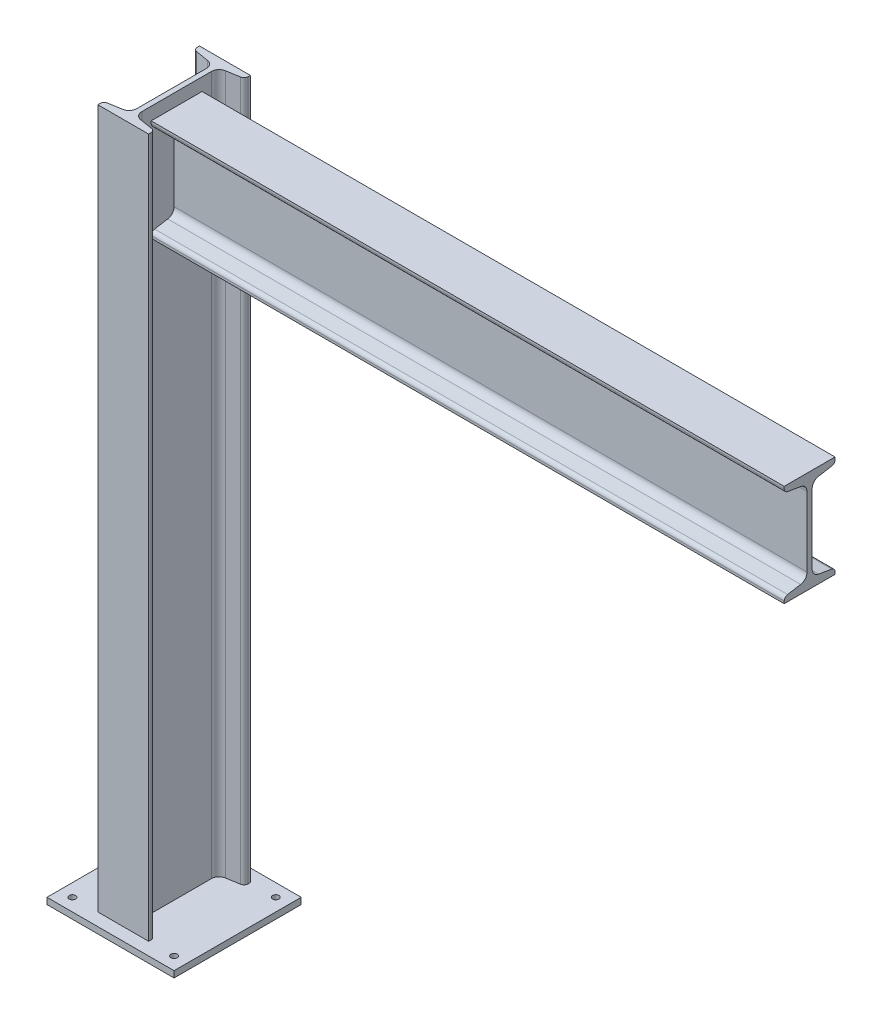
ISO-10303-21;
HEADER;
FILE_DESCRIPTION(('STEP AP214'),'2;1');
FILE_NAME('part.step','',(''),(''),'','','');
FILE_SCHEMA(('AUTOMOTIVE_DESIGN { 1 0 10303 214 1 1 1 1 }'));
ENDSEC;
DATA;
#1=APPLICATION_CONTEXT('core data for automotive mechanical design processes');
#2=APPLICATION_PROTOCOL_DEFINITION('international standard','automotive_design',2000,#1);
#3=PRODUCT_CONTEXT('',#1,'mechanical');
#4=PRODUCT('Part','Part','',(#3));
#5=PRODUCT_RELATED_PRODUCT_CATEGORY('part','',(#4));
#6=PRODUCT_DEFINITION_FORMATION('','',#4);
#7=PRODUCT_DEFINITION_CONTEXT('part definition',#1,'design');
#8=PRODUCT_DEFINITION('design','',#6,#7);
#9=PRODUCT_DEFINITION_SHAPE('','',#8);
#10=(LENGTH_UNIT() NAMED_UNIT(*) SI_UNIT(.MILLI.,.METRE.));
#11=(NAMED_UNIT(*) PLANE_ANGLE_UNIT() SI_UNIT($,.RADIAN.));
#12=(NAMED_UNIT(*) SI_UNIT($,.STERADIAN.) SOLID_ANGLE_UNIT());
#13=UNCERTAINTY_MEASURE_WITH_UNIT(LENGTH_MEASURE(1.E-05),#10,'distance_accuracy_value','');
#14=(GEOMETRIC_REPRESENTATION_CONTEXT(3) GLOBAL_UNCERTAINTY_ASSIGNED_CONTEXT((#13)) GLOBAL_UNIT_ASSIGNED_CONTEXT((#10,
#11,#12)) REPRESENTATION_CONTEXT('',''));
#15=CARTESIAN_POINT('',(0.,0.,0.));
#16=DIRECTION('',(0.,0.,1.));
#17=DIRECTION('',(1.,0.,0.));
#18=AXIS2_PLACEMENT_3D('',#15,#16,#17);
#19=CARTESIAN_POINT('',(50.,0.,-50.));
#20=DIRECTION('',(-1.,0.,0.));
#21=DIRECTION('',(0.,0.,1.));
#22=AXIS2_PLACEMENT_3D('',#19,#20,#21);
#23=PLANE('',#22);
#24=DIRECTION('',(0.,0.,-1.));
#25=VECTOR('',#24,1.);
#26=CARTESIAN_POINT('',(50.,-5.,-50.));
#27=LINE('',#26,#25);
#28=CARTESIAN_POINT('',(50.,-5.,50.));
#29=VERTEX_POINT('',#28);
#30=CARTESIAN_POINT('',(50.,-5.,-50.));
#31=VERTEX_POINT('',#30);
#32=EDGE_CURVE('E203',#29,#31,#27,.T.);
#33=ORIENTED_EDGE('',*,*,#32,.T.);
#34=DIRECTION('',(0.,-1.,0.));
#35=VECTOR('',#34,1.);
#36=CARTESIAN_POINT('',(50.,0.,-50.));
#37=LINE('',#36,#35);
#38=CARTESIAN_POINT('',(50.,0.,-50.));
#39=VERTEX_POINT('',#38);
#40=EDGE_CURVE('E13',#39,#31,#37,.T.);
#41=ORIENTED_EDGE('',*,*,#40,.F.);
#42=DIRECTION('',(0.,0.,-1.));
#43=VECTOR('',#42,1.);
#44=CARTESIAN_POINT('',(50.,0.,-50.));
#45=LINE('',#44,#43);
#46=CARTESIAN_POINT('',(50.,0.,50.));
#47=VERTEX_POINT('',#46);
#48=EDGE_CURVE('E191',#47,#39,#45,.T.);
#49=ORIENTED_EDGE('',*,*,#48,.F.);
#50=DIRECTION('',(0.,-1.,0.));
#51=VECTOR('',#50,1.);
#52=CARTESIAN_POINT('',(50.,0.,50.));
#53=LINE('',#52,#51);
#54=EDGE_CURVE('E199',#47,#29,#53,.T.);
#55=ORIENTED_EDGE('',*,*,#54,.T.);
#56=EDGE_LOOP('',(#33,#41,#49,#55));
#57=FACE_BOUND('',#56,.T.);
#58=ADVANCED_FACE('F140',(#57),#23,.F.);
#59=CARTESIAN_POINT('',(-50.,0.,-50.));
#60=DIRECTION('',(0.,0.,1.));
#61=DIRECTION('',(1.,0.,0.));
#62=AXIS2_PLACEMENT_3D('',#59,#60,#61);
#63=PLANE('',#62);
#64=DIRECTION('',(-1.,0.,0.));
#65=VECTOR('',#64,1.);
#66=CARTESIAN_POINT('',(-50.,-5.,-50.));
#67=LINE('',#66,#65);
#68=CARTESIAN_POINT('',(-50.,-5.,-50.));
#69=VERTEX_POINT('',#68);
#70=EDGE_CURVE('E195',#31,#69,#67,.T.);
#71=ORIENTED_EDGE('',*,*,#70,.T.);
#72=DIRECTION('',(0.,-1.,0.));
#73=VECTOR('',#72,1.);
#74=CARTESIAN_POINT('',(-50.,0.,-50.));
#75=LINE('',#74,#73);
#76=CARTESIAN_POINT('',(-50.,0.,-50.));
#77=VERTEX_POINT('',#76);
#78=EDGE_CURVE('E148',#77,#69,#75,.T.);
#79=ORIENTED_EDGE('',*,*,#78,.F.);
#80=DIRECTION('',(-1.,0.,0.));
#81=VECTOR('',#80,1.);
#82=CARTESIAN_POINT('',(-50.,0.,-50.));
#83=LINE('',#82,#81);
#84=EDGE_CURVE('E186',#39,#77,#83,.T.);
#85=ORIENTED_EDGE('',*,*,#84,.F.);
#86=ORIENTED_EDGE('',*,*,#40,.T.);
#87=EDGE_LOOP('',(#71,#79,#85,#86));
#88=FACE_BOUND('',#87,.T.);
#89=ADVANCED_FACE('F194',(#88),#63,.F.);
#90=CARTESIAN_POINT('',(-50.,0.,-50.));
#91=DIRECTION('',(1.,0.,0.));
#92=DIRECTION('',(0.,0.,-1.));
#93=AXIS2_PLACEMENT_3D('',#90,#91,#92);
#94=PLANE('',#93);
#95=DIRECTION('',(0.,0.,1.));
#96=VECTOR('',#95,1.);
#97=CARTESIAN_POINT('',(-50.,-5.,-50.));
#98=LINE('',#97,#96);
#99=CARTESIAN_POINT('',(-50.,-5.,50.));
#100=VERTEX_POINT('',#99);
#101=EDGE_CURVE('E173',#69,#100,#98,.T.);
#102=ORIENTED_EDGE('',*,*,#101,.T.);
#103=DIRECTION('',(0.,-1.,0.));
#104=VECTOR('',#103,1.);
#105=CARTESIAN_POINT('',(-50.,0.,50.));
#106=LINE('',#105,#104);
#107=CARTESIAN_POINT('',(-50.,0.,50.));
#108=VERTEX_POINT('',#107);
#109=EDGE_CURVE('E196',#108,#100,#106,.T.);
#110=ORIENTED_EDGE('',*,*,#109,.F.);
#111=DIRECTION('',(0.,0.,1.));
#112=VECTOR('',#111,1.);
#113=CARTESIAN_POINT('',(-50.,0.,-50.));
#114=LINE('',#113,#112);
#115=EDGE_CURVE('E189',#77,#108,#114,.T.);
#116=ORIENTED_EDGE('',*,*,#115,.F.);
#117=ORIENTED_EDGE('',*,*,#78,.T.);
#118=EDGE_LOOP('',(#102,#110,#116,#117));
#119=FACE_BOUND('',#118,.T.);
#120=ADVANCED_FACE('F197',(#119),#94,.F.);
#121=CARTESIAN_POINT('',(-50.,0.,50.));
#122=DIRECTION('',(0.,0.,-1.));
#123=DIRECTION('',(-1.,0.,0.));
#124=AXIS2_PLACEMENT_3D('',#121,#122,#123);
#125=PLANE('',#124);
#126=DIRECTION('',(1.,0.,0.));
#127=VECTOR('',#126,1.);
#128=CARTESIAN_POINT('',(-50.,-5.,50.));
#129=LINE('',#128,#127);
#130=EDGE_CURVE('E179',#100,#29,#129,.T.);
#131=ORIENTED_EDGE('',*,*,#130,.T.);
#132=ORIENTED_EDGE('',*,*,#54,.F.);
#133=DIRECTION('',(1.,0.,0.));
#134=VECTOR('',#133,1.);
#135=CARTESIAN_POINT('',(-50.,0.,50.));
#136=LINE('',#135,#134);
#137=EDGE_CURVE('E156',#108,#47,#136,.T.);
#138=ORIENTED_EDGE('',*,*,#137,.F.);
#139=ORIENTED_EDGE('',*,*,#109,.T.);
#140=EDGE_LOOP('',(#131,#132,#138,#139));
#141=FACE_BOUND('',#140,.T.);
#142=ADVANCED_FACE('F211',(#141),#125,.F.);
#143=CARTESIAN_POINT('',(0.,0.,0.));
#144=DIRECTION('',(0.,1.,0.));
#145=DIRECTION('',(0.,0.,1.));
#146=AXIS2_PLACEMENT_3D('',#143,#144,#145);
#147=PLANE('',#146);
#148=CARTESIAN_POINT('',(-40.,0.,-40.));
#149=DIRECTION('',(0.,1.,0.));
#150=DIRECTION('',(0.,0.,1.));
#151=AXIS2_PLACEMENT_3D('',#148,#149,#150);
#152=CIRCLE('',#151,2.49999999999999);
#153=CARTESIAN_POINT('',(-40.,0.,-37.5));
#154=VERTEX_POINT('',#153);
#155=EDGE_CURVE('E246',#154,#154,#152,.T.);
#156=ORIENTED_EDGE('',*,*,#155,.F.);
#157=EDGE_LOOP('',(#156));
#158=FACE_BOUND('',#157,.T.);
#159=CARTESIAN_POINT('',(-40.,0.,40.));
#160=DIRECTION('',(0.,1.,0.));
#161=DIRECTION('',(0.,0.,1.));
#162=AXIS2_PLACEMENT_3D('',#159,#160,#161);
#163=CIRCLE('',#162,2.49999999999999);
#164=CARTESIAN_POINT('',(-40.,0.,42.5));
#165=VERTEX_POINT('',#164);
#166=EDGE_CURVE('E237',#165,#165,#163,.T.);
#167=ORIENTED_EDGE('',*,*,#166,.F.);
#168=EDGE_LOOP('',(#167));
#169=FACE_BOUND('',#168,.T.);
#170=CARTESIAN_POINT('',(40.,0.,-40.));
#171=DIRECTION('',(0.,1.,0.));
#172=DIRECTION('',(0.,0.,1.));
#173=AXIS2_PLACEMENT_3D('',#170,#171,#172);
#174=CIRCLE('',#173,2.49999999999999);
#175=CARTESIAN_POINT('',(40.,0.,-37.5));
#176=VERTEX_POINT('',#175);
#177=EDGE_CURVE('E228',#176,#176,#174,.T.);
#178=ORIENTED_EDGE('',*,*,#177,.F.);
#179=EDGE_LOOP('',(#178));
#180=FACE_BOUND('',#179,.T.);
#181=CARTESIAN_POINT('',(40.,0.,40.));
#182=DIRECTION('',(0.,1.,0.));
#183=DIRECTION('',(0.,0.,1.));
#184=AXIS2_PLACEMENT_3D('',#181,#182,#183);
#185=CIRCLE('',#184,2.49999999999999);
#186=CARTESIAN_POINT('',(40.,0.,42.5));
#187=VERTEX_POINT('',#186);
#188=EDGE_CURVE('E219',#187,#187,#185,.T.);
#189=ORIENTED_EDGE('',*,*,#188,.F.);
#190=EDGE_LOOP('',(#189));
#191=FACE_BOUND('',#190,.T.);
#192=ORIENTED_EDGE('',*,*,#48,.T.);
#193=ORIENTED_EDGE('',*,*,#84,.T.);
#194=ORIENTED_EDGE('',*,*,#115,.T.);
#195=ORIENTED_EDGE('',*,*,#137,.T.);
#196=EDGE_LOOP('',(#192,#193,#194,#195));
#197=FACE_BOUND('',#196,.T.);
#198=ADVANCED_FACE('F187',(#158,#169,#180,#191,#197),#147,.T.);
#199=CARTESIAN_POINT('',(0.,-5.,0.));
#200=DIRECTION('',(0.,1.,0.));
#201=DIRECTION('',(0.,0.,1.));
#202=AXIS2_PLACEMENT_3D('',#199,#200,#201);
#203=PLANE('',#202);
#204=CARTESIAN_POINT('',(-40.,-5.,-40.));
#205=DIRECTION('',(0.,1.,0.));
#206=DIRECTION('',(0.,0.,1.));
#207=AXIS2_PLACEMENT_3D('',#204,#205,#206);
#208=CIRCLE('',#207,2.525);
#209=CARTESIAN_POINT('',(-40.,-5.,-37.475));
#210=VERTEX_POINT('',#209);
#211=EDGE_CURVE('E249',#210,#210,#208,.T.);
#212=ORIENTED_EDGE('',*,*,#211,.T.);
#213=EDGE_LOOP('',(#212));
#214=FACE_BOUND('',#213,.T.);
#215=CARTESIAN_POINT('',(-40.,-5.,40.));
#216=DIRECTION('',(0.,1.,0.));
#217=DIRECTION('',(0.,0.,1.));
#218=AXIS2_PLACEMENT_3D('',#215,#216,#217);
#219=CIRCLE('',#218,2.525);
#220=CARTESIAN_POINT('',(-40.,-5.,42.525));
#221=VERTEX_POINT('',#220);
#222=EDGE_CURVE('E240',#221,#221,#219,.T.);
#223=ORIENTED_EDGE('',*,*,#222,.T.);
#224=EDGE_LOOP('',(#223));
#225=FACE_BOUND('',#224,.T.);
#226=CARTESIAN_POINT('',(40.,-5.,-40.));
#227=DIRECTION('',(0.,1.,0.));
#228=DIRECTION('',(0.,0.,1.));
#229=AXIS2_PLACEMENT_3D('',#226,#227,#228);
#230=CIRCLE('',#229,2.525);
#231=CARTESIAN_POINT('',(40.,-5.,-37.475));
#232=VERTEX_POINT('',#231);
#233=EDGE_CURVE('E231',#232,#232,#230,.T.);
#234=ORIENTED_EDGE('',*,*,#233,.T.);
#235=EDGE_LOOP('',(#234));
#236=FACE_BOUND('',#235,.T.);
#237=CARTESIAN_POINT('',(40.,-5.,40.));
#238=DIRECTION('',(0.,1.,0.));
#239=DIRECTION('',(0.,0.,1.));
#240=AXIS2_PLACEMENT_3D('',#237,#238,#239);
#241=CIRCLE('',#240,2.525);
#242=CARTESIAN_POINT('',(40.,-5.,42.525));
#243=VERTEX_POINT('',#242);
#244=EDGE_CURVE('E222',#243,#243,#241,.T.);
#245=ORIENTED_EDGE('',*,*,#244,.T.);
#246=EDGE_LOOP('',(#245));
#247=FACE_BOUND('',#246,.T.);
#248=ORIENTED_EDGE('',*,*,#32,.F.);
#249=ORIENTED_EDGE('',*,*,#130,.F.);
#250=ORIENTED_EDGE('',*,*,#101,.F.);
#251=ORIENTED_EDGE('',*,*,#70,.F.);
#252=EDGE_LOOP('',(#248,#249,#250,#251));
#253=FACE_BOUND('',#252,.T.);
#254=ADVANCED_FACE('F214',(#214,#225,#236,#247,#253),#203,.F.);
#255=CARTESIAN_POINT('',(40.,-4.97500000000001,40.));
#256=DIRECTION('',(0.,-1.,0.));
#257=DIRECTION('',(0.,0.,-1.));
#258=AXIS2_PLACEMENT_3D('',#255,#256,#257);
#259=CONICAL_SURFACE('',#258,2.49999999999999,0.785398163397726);
#260=ORIENTED_EDGE('',*,*,#244,.F.);
#261=EDGE_LOOP('',(#260));
#262=FACE_BOUND('',#261,.T.);
#263=CARTESIAN_POINT('',(40.,-4.97500000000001,40.));
#264=DIRECTION('',(0.,1.,0.));
#265=DIRECTION('',(0.,0.,1.));
#266=AXIS2_PLACEMENT_3D('',#263,#264,#265);
#267=CIRCLE('',#266,2.49999999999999);
#268=CARTESIAN_POINT('',(40.,-4.97500000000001,42.5));
#269=VERTEX_POINT('',#268);
#270=EDGE_CURVE('E206',#269,#269,#267,.T.);
#271=ORIENTED_EDGE('',*,*,#270,.T.);
#272=EDGE_LOOP('',(#271));
#273=FACE_BOUND('',#272,.T.);
#274=ADVANCED_FACE('F280',(#262,#273),#259,.F.);
#275=CARTESIAN_POINT('',(40.,0.,40.));
#276=DIRECTION('',(0.,1.,0.));
#277=DIRECTION('',(0.,0.,1.));
#278=AXIS2_PLACEMENT_3D('',#275,#276,#277);
#279=CYLINDRICAL_SURFACE('',#278,2.49999999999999);
#280=ORIENTED_EDGE('',*,*,#270,.F.);
#281=EDGE_LOOP('',(#280));
#282=FACE_BOUND('',#281,.T.);
#283=ORIENTED_EDGE('',*,*,#188,.T.);
#284=EDGE_LOOP('',(#283));
#285=FACE_BOUND('',#284,.T.);
#286=ADVANCED_FACE('F277',(#282,#285),#279,.F.);
#287=CARTESIAN_POINT('',(40.,-4.97500000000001,-40.));
#288=DIRECTION('',(0.,-1.,0.));
#289=DIRECTION('',(0.,0.,-1.));
#290=AXIS2_PLACEMENT_3D('',#287,#288,#289);
#291=CONICAL_SURFACE('',#290,2.49999999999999,0.785398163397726);
#292=ORIENTED_EDGE('',*,*,#233,.F.);
#293=EDGE_LOOP('',(#292));
#294=FACE_BOUND('',#293,.T.);
#295=CARTESIAN_POINT('',(40.,-4.97500000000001,-40.));
#296=DIRECTION('',(0.,1.,0.));
#297=DIRECTION('',(0.,0.,1.));
#298=AXIS2_PLACEMENT_3D('',#295,#296,#297);
#299=CIRCLE('',#298,2.49999999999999);
#300=CARTESIAN_POINT('',(40.,-4.97500000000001,-37.5));
#301=VERTEX_POINT('',#300);
#302=EDGE_CURVE('E225',#301,#301,#299,.T.);
#303=ORIENTED_EDGE('',*,*,#302,.T.);
#304=EDGE_LOOP('',(#303));
#305=FACE_BOUND('',#304,.T.);
#306=ADVANCED_FACE('F279',(#294,#305),#291,.F.);
#307=CARTESIAN_POINT('',(40.,0.,-40.));
#308=DIRECTION('',(0.,1.,0.));
#309=DIRECTION('',(0.,0.,1.));
#310=AXIS2_PLACEMENT_3D('',#307,#308,#309);
#311=CYLINDRICAL_SURFACE('',#310,2.49999999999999);
#312=ORIENTED_EDGE('',*,*,#302,.F.);
#313=EDGE_LOOP('',(#312));
#314=FACE_BOUND('',#313,.T.);
#315=ORIENTED_EDGE('',*,*,#177,.T.);
#316=EDGE_LOOP('',(#315));
#317=FACE_BOUND('',#316,.T.);
#318=ADVANCED_FACE('F287',(#314,#317),#311,.F.);
#319=CARTESIAN_POINT('',(-40.,-4.97500000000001,40.));
#320=DIRECTION('',(0.,-1.,0.));
#321=DIRECTION('',(0.,0.,-1.));
#322=AXIS2_PLACEMENT_3D('',#319,#320,#321);
#323=CONICAL_SURFACE('',#322,2.49999999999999,0.785398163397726);
#324=ORIENTED_EDGE('',*,*,#222,.F.);
#325=EDGE_LOOP('',(#324));
#326=FACE_BOUND('',#325,.T.);
#327=CARTESIAN_POINT('',(-40.,-4.97500000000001,40.));
#328=DIRECTION('',(0.,1.,0.));
#329=DIRECTION('',(0.,0.,1.));
#330=AXIS2_PLACEMENT_3D('',#327,#328,#329);
#331=CIRCLE('',#330,2.49999999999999);
#332=CARTESIAN_POINT('',(-40.,-4.97500000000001,42.5));
#333=VERTEX_POINT('',#332);
#334=EDGE_CURVE('E234',#333,#333,#331,.T.);
#335=ORIENTED_EDGE('',*,*,#334,.T.);
#336=EDGE_LOOP('',(#335));
#337=FACE_BOUND('',#336,.T.);
#338=ADVANCED_FACE('F335',(#326,#337),#323,.F.);
#339=CARTESIAN_POINT('',(-40.,0.,40.));
#340=DIRECTION('',(0.,1.,0.));
#341=DIRECTION('',(0.,0.,1.));
#342=AXIS2_PLACEMENT_3D('',#339,#340,#341);
#343=CYLINDRICAL_SURFACE('',#342,2.49999999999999);
#344=ORIENTED_EDGE('',*,*,#334,.F.);
#345=EDGE_LOOP('',(#344));
#346=FACE_BOUND('',#345,.T.);
#347=ORIENTED_EDGE('',*,*,#166,.T.);
#348=EDGE_LOOP('',(#347));
#349=FACE_BOUND('',#348,.T.);
#350=ADVANCED_FACE('F259',(#346,#349),#343,.F.);
#351=CARTESIAN_POINT('',(-40.,-4.97500000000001,-40.));
#352=DIRECTION('',(0.,-1.,0.));
#353=DIRECTION('',(0.,0.,-1.));
#354=AXIS2_PLACEMENT_3D('',#351,#352,#353);
#355=CONICAL_SURFACE('',#354,2.49999999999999,0.785398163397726);
#356=ORIENTED_EDGE('',*,*,#211,.F.);
#357=EDGE_LOOP('',(#356));
#358=FACE_BOUND('',#357,.T.);
#359=CARTESIAN_POINT('',(-40.,-4.97500000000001,-40.));
#360=DIRECTION('',(0.,1.,0.));
#361=DIRECTION('',(0.,0.,1.));
#362=AXIS2_PLACEMENT_3D('',#359,#360,#361);
#363=CIRCLE('',#362,2.49999999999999);
#364=CARTESIAN_POINT('',(-40.,-4.97500000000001,-37.5));
#365=VERTEX_POINT('',#364);
#366=EDGE_CURVE('E243',#365,#365,#363,.T.);
#367=ORIENTED_EDGE('',*,*,#366,.T.);
#368=EDGE_LOOP('',(#367));
#369=FACE_BOUND('',#368,.T.);
#370=ADVANCED_FACE('F255',(#358,#369),#355,.F.);
#371=CARTESIAN_POINT('',(-40.,0.,-40.));
#372=DIRECTION('',(0.,1.,0.));
#373=DIRECTION('',(0.,0.,1.));
#374=AXIS2_PLACEMENT_3D('',#371,#372,#373);
#375=CYLINDRICAL_SURFACE('',#374,2.49999999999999);
#376=ORIENTED_EDGE('',*,*,#366,.F.);
#377=EDGE_LOOP('',(#376));
#378=FACE_BOUND('',#377,.T.);
#379=ORIENTED_EDGE('',*,*,#155,.T.);
#380=EDGE_LOOP('',(#379));
#381=FACE_BOUND('',#380,.T.);
#382=ADVANCED_FACE('F258',(#378,#381),#375,.F.);
#383=CLOSED_SHELL('',(#58,#89,#120,#142,#198,#254,#274,#286,#306,#318,#338,#350,#370,#382));
#384=MANIFOLD_SOLID_BREP('B2',#383);
#385=CARTESIAN_POINT('',(500.,461.810483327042,-16.8249999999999));
#386=DIRECTION('',(1.,0.,0.));
#387=DIRECTION('',(0.,1.,0.));
#388=AXIS2_PLACEMENT_3D('',#385,#386,#387);
#389=PLANE('',#388);
#390=DIRECTION('',(0.,0.,1.));
#391=VECTOR('',#390,1.);
#392=CARTESIAN_POINT('',(500.,460.,20.0000000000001));
#393=LINE('',#392,#391);
#394=CARTESIAN_POINT('',(500.,460.,-19.9999999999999));
#395=VERTEX_POINT('',#394);
#396=CARTESIAN_POINT('',(500.,460.,20.0000000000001));
#397=VERTEX_POINT('',#396);
#398=EDGE_CURVE('E573',#395,#397,#393,.T.);
#399=ORIENTED_EDGE('',*,*,#398,.F.);
#400=DIRECTION('',(0.,-1.,0.));
#401=VECTOR('',#400,1.);
#402=CARTESIAN_POINT('',(500.,460.,-19.9999999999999));
#403=LINE('',#402,#401);
#404=CARTESIAN_POINT('',(500.,461.810483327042,-19.9999999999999));
#405=VERTEX_POINT('',#404);
#406=EDGE_CURVE('E579',#405,#395,#403,.T.);
#407=ORIENTED_EDGE('',*,*,#406,.F.);
#408=CARTESIAN_POINT('',(500.,461.810483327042,-16.8249999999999));
#409=DIRECTION('',(-1.,0.,0.));
#410=DIRECTION('',(0.,1.,0.));
#411=AXIS2_PLACEMENT_3D('',#408,#409,#410);
#412=CIRCLE('',#411,3.17500000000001);
#413=CARTESIAN_POINT('',(500.,464.942277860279,-17.3470038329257));
#414=VERTEX_POINT('',#413);
#415=EDGE_CURVE('E677',#414,#405,#412,.T.);
#416=ORIENTED_EDGE('',*,*,#415,.F.);
#417=DIRECTION('',(0.,-0.164410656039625,-0.986391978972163));
#418=VECTOR('',#417,1.);
#419=CARTESIAN_POINT('',(500.,464.942277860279,-17.3470038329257));
#420=LINE('',#419,#418);
#421=CARTESIAN_POINT('',(500.,466.664648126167,-7.01353606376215));
#422=VERTEX_POINT('',#421);
#423=EDGE_CURVE('E672',#422,#414,#420,.T.);
#424=ORIENTED_EDGE('',*,*,#423,.F.);
#425=CARTESIAN_POINT('',(500.,472.583,-7.99999999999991));
#426=DIRECTION('',(1.,0.,0.));
#427=DIRECTION('',(0.,-1.,0.));
#428=AXIS2_PLACEMENT_3D('',#425,#426,#427);
#429=CIRCLE('',#428,6.);
#430=CARTESIAN_POINT('',(500.,472.583,-1.99999999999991));
#431=VERTEX_POINT('',#430);
#432=EDGE_CURVE('E667',#431,#422,#429,.T.);
#433=ORIENTED_EDGE('',*,*,#432,.F.);
#434=DIRECTION('',(0.,-1.,0.));
#435=VECTOR('',#434,1.);
#436=CARTESIAN_POINT('',(500.,472.583,-1.9999999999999));
#437=LINE('',#436,#435);
#438=CARTESIAN_POINT('',(500.,527.417,-2.0000000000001));
#439=VERTEX_POINT('',#438);
#440=EDGE_CURVE('E662',#439,#431,#437,.T.);
#441=ORIENTED_EDGE('',*,*,#440,.F.);
#442=CARTESIAN_POINT('',(500.,527.417,-8.00000000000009));
#443=DIRECTION('',(1.,0.,0.));
#444=DIRECTION('',(0.,-1.,0.));
#445=AXIS2_PLACEMENT_3D('',#442,#443,#444);
#446=CIRCLE('',#445,5.99999999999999);
#447=CARTESIAN_POINT('',(500.,533.335351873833,-7.01353606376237));
#448=VERTEX_POINT('',#447);
#449=EDGE_CURVE('E657',#448,#439,#446,.T.);
#450=ORIENTED_EDGE('',*,*,#449,.F.);
#451=DIRECTION('',(0.,-0.164410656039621,0.986391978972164));
#452=VECTOR('',#451,1.);
#453=CARTESIAN_POINT('',(500.,533.335351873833,-7.01353606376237));
#454=LINE('',#453,#452);
#455=CARTESIAN_POINT('',(500.,535.057722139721,-17.3470038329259));
#456=VERTEX_POINT('',#455);
#457=EDGE_CURVE('E652',#456,#448,#454,.T.);
#458=ORIENTED_EDGE('',*,*,#457,.F.);
#459=CARTESIAN_POINT('',(500.,538.189516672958,-16.8250000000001));
#460=DIRECTION('',(-1.,0.,0.));
#461=DIRECTION('',(0.,1.,0.));
#462=AXIS2_PLACEMENT_3D('',#459,#460,#461);
#463=CIRCLE('',#462,3.175);
#464=CARTESIAN_POINT('',(500.,538.189516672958,-20.0000000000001));
#465=VERTEX_POINT('',#464);
#466=EDGE_CURVE('E647',#465,#456,#463,.T.);
#467=ORIENTED_EDGE('',*,*,#466,.F.);
#468=DIRECTION('',(0.,-1.,0.));
#469=VECTOR('',#468,1.);
#470=CARTESIAN_POINT('',(500.,538.189516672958,-20.0000000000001));
#471=LINE('',#470,#469);
#472=CARTESIAN_POINT('',(500.,540.,-20.0000000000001));
#473=VERTEX_POINT('',#472);
#474=EDGE_CURVE('E642',#473,#465,#471,.T.);
#475=ORIENTED_EDGE('',*,*,#474,.F.);
#476=DIRECTION('',(0.,0.,-1.));
#477=VECTOR('',#476,1.);
#478=CARTESIAN_POINT('',(500.,540.,-20.0000000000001));
#479=LINE('',#478,#477);
#480=CARTESIAN_POINT('',(500.,540.,19.9999999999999));
#481=VERTEX_POINT('',#480);
#482=EDGE_CURVE('E637',#481,#473,#479,.T.);
#483=ORIENTED_EDGE('',*,*,#482,.F.);
#484=DIRECTION('',(0.,1.,0.));
#485=VECTOR('',#484,1.);
#486=CARTESIAN_POINT('',(500.,540.,19.9999999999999));
#487=LINE('',#486,#485);
#488=CARTESIAN_POINT('',(500.,538.189516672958,19.9999999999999));
#489=VERTEX_POINT('',#488);
#490=EDGE_CURVE('E632',#489,#481,#487,.T.);
#491=ORIENTED_EDGE('',*,*,#490,.F.);
#492=CARTESIAN_POINT('',(500.,538.189516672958,16.8249999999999));
#493=DIRECTION('',(-1.,0.,0.));
#494=DIRECTION('',(0.,-1.,0.));
#495=AXIS2_PLACEMENT_3D('',#492,#493,#494);
#496=CIRCLE('',#495,3.175);
#497=CARTESIAN_POINT('',(500.,535.057722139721,17.3470038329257));
#498=VERTEX_POINT('',#497);
#499=EDGE_CURVE('E627',#498,#489,#496,.T.);
#500=ORIENTED_EDGE('',*,*,#499,.F.);
#501=DIRECTION('',(0.,0.164410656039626,0.986391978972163));
#502=VECTOR('',#501,1.);
#503=CARTESIAN_POINT('',(500.,535.057722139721,17.3470038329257));
#504=LINE('',#503,#502);
#505=CARTESIAN_POINT('',(500.,533.335351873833,7.01353606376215));
#506=VERTEX_POINT('',#505);
#507=EDGE_CURVE('E622',#506,#498,#504,.T.);
#508=ORIENTED_EDGE('',*,*,#507,.F.);
#509=CARTESIAN_POINT('',(500.,527.417,7.99999999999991));
#510=DIRECTION('',(1.,0.,0.));
#511=DIRECTION('',(0.,-1.,0.));
#512=AXIS2_PLACEMENT_3D('',#509,#510,#511);
#513=CIRCLE('',#512,6.00000000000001);
#514=CARTESIAN_POINT('',(500.,527.417,1.99999999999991));
#515=VERTEX_POINT('',#514);
#516=EDGE_CURVE('E617',#515,#506,#513,.T.);
#517=ORIENTED_EDGE('',*,*,#516,.F.);
#518=DIRECTION('',(0.,1.,0.));
#519=VECTOR('',#518,1.);
#520=CARTESIAN_POINT('',(500.,527.417,1.9999999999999));
#521=LINE('',#520,#519);
#522=CARTESIAN_POINT('',(500.,472.583,2.00000000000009));
#523=VERTEX_POINT('',#522);
#524=EDGE_CURVE('E612',#523,#515,#521,.T.);
#525=ORIENTED_EDGE('',*,*,#524,.F.);
#526=CARTESIAN_POINT('',(500.,472.583,8.0000000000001));
#527=DIRECTION('',(1.,0.,0.));
#528=DIRECTION('',(0.,-1.,0.));
#529=AXIS2_PLACEMENT_3D('',#526,#527,#528);
#530=CIRCLE('',#529,6.);
#531=CARTESIAN_POINT('',(500.,466.664648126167,7.01353606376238));
#532=VERTEX_POINT('',#531);
#533=EDGE_CURVE('E607',#532,#523,#530,.T.);
#534=ORIENTED_EDGE('',*,*,#533,.F.);
#535=DIRECTION('',(0.,0.16441065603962,-0.986391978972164));
#536=VECTOR('',#535,1.);
#537=CARTESIAN_POINT('',(500.,466.664648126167,7.01353606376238));
#538=LINE('',#537,#536);
#539=CARTESIAN_POINT('',(500.,464.942277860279,17.3470038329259));
#540=VERTEX_POINT('',#539);
#541=EDGE_CURVE('E602',#540,#532,#538,.T.);
#542=ORIENTED_EDGE('',*,*,#541,.F.);
#543=CARTESIAN_POINT('',(500.,461.810483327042,16.8250000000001));
#544=DIRECTION('',(-1.,0.,0.));
#545=DIRECTION('',(0.,-1.,0.));
#546=AXIS2_PLACEMENT_3D('',#543,#544,#545);
#547=CIRCLE('',#546,3.175);
#548=CARTESIAN_POINT('',(500.,461.810483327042,20.0000000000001));
#549=VERTEX_POINT('',#548);
#550=EDGE_CURVE('E597',#549,#540,#547,.T.);
#551=ORIENTED_EDGE('',*,*,#550,.F.);
#552=DIRECTION('',(0.,1.,0.));
#553=VECTOR('',#552,1.);
#554=CARTESIAN_POINT('',(500.,461.810483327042,20.0000000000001));
#555=LINE('',#554,#553);
#556=EDGE_CURVE('E588',#397,#549,#555,.T.);
#557=ORIENTED_EDGE('',*,*,#556,.F.);
#558=EDGE_LOOP('',(#399,#407,#416,#424,#433,#441,#450,#458,#467,#475,#483,#491,#500,#508,#517,
#525,#534,#542,#551,#557));
#559=FACE_BOUND('',#558,.T.);
#560=ADVANCED_FACE('F432',(#559),#389,.T.);
#561=CARTESIAN_POINT('',(0.,460.,-19.9999999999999));
#562=DIRECTION('',(0.,0.,1.));
#563=DIRECTION('',(0.,-1.,0.));
#564=AXIS2_PLACEMENT_3D('',#561,#562,#563);
#565=PLANE('',#564);
#566=DIRECTION('',(1.,0.,0.));
#567=VECTOR('',#566,1.);
#568=CARTESIAN_POINT('',(0.,460.,-19.9999999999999));
#569=LINE('',#568,#567);
#570=CARTESIAN_POINT('',(2.,460.,-19.9999999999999));
#571=VERTEX_POINT('',#570);
#572=EDGE_CURVE('E568',#571,#395,#569,.T.);
#573=ORIENTED_EDGE('',*,*,#572,.F.);
#574=DIRECTION('',(0.,1.,0.));
#575=VECTOR('',#574,1.);
#576=CARTESIAN_POINT('',(2.,460.,-19.9999999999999));
#577=LINE('',#576,#575);
#578=CARTESIAN_POINT('',(2.,461.810483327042,-19.9999999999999));
#579=VERTEX_POINT('',#578);
#580=EDGE_CURVE('E435',#571,#579,#577,.T.);
#581=ORIENTED_EDGE('',*,*,#580,.T.);
#582=DIRECTION('',(1.,0.,0.));
#583=VECTOR('',#582,1.);
#584=CARTESIAN_POINT('',(0.,461.810483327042,-19.9999999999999));
#585=LINE('',#584,#583);
#586=EDGE_CURVE('E582',#579,#405,#585,.T.);
#587=ORIENTED_EDGE('',*,*,#586,.T.);
#588=ORIENTED_EDGE('',*,*,#406,.T.);
#589=EDGE_LOOP('',(#573,#581,#587,#588));
#590=FACE_BOUND('',#589,.T.);
#591=ADVANCED_FACE('F580',(#590),#565,.F.);
#592=CARTESIAN_POINT('',(0.,461.810483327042,-16.8249999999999));
#593=DIRECTION('',(1.,0.,0.));
#594=DIRECTION('',(0.,0.,-1.));
#595=AXIS2_PLACEMENT_3D('',#592,#593,#594);
#596=CYLINDRICAL_SURFACE('',#595,3.17500000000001);
#597=ORIENTED_EDGE('',*,*,#586,.F.);
#598=CARTESIAN_POINT('',(2.,461.810483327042,-16.8249999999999));
#599=DIRECTION('',(1.,0.,0.));
#600=DIRECTION('',(0.,0.,-1.));
#601=AXIS2_PLACEMENT_3D('',#598,#599,#600);
#602=CIRCLE('',#601,3.17500000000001);
#603=CARTESIAN_POINT('',(2.,464.942277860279,-17.3470038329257));
#604=VERTEX_POINT('',#603);
#605=EDGE_CURVE('E793',#579,#604,#602,.T.);
#606=ORIENTED_EDGE('',*,*,#605,.T.);
#607=DIRECTION('',(1.,0.,0.));
#608=VECTOR('',#607,1.);
#609=CARTESIAN_POINT('',(0.,464.942277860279,-17.3470038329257));
#610=LINE('',#609,#608);
#611=EDGE_CURVE('E675',#604,#414,#610,.T.);
#612=ORIENTED_EDGE('',*,*,#611,.T.);
#613=ORIENTED_EDGE('',*,*,#415,.T.);
#614=EDGE_LOOP('',(#597,#606,#612,#613));
#615=FACE_BOUND('',#614,.T.);
#616=ADVANCED_FACE('F680',(#615),#596,.T.);
#617=CARTESIAN_POINT('',(0.,464.942277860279,-17.3470038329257));
#618=DIRECTION('',(0.,-0.986391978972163,0.164410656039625));
#619=DIRECTION('',(0.,-0.164410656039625,-0.986391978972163));
#620=AXIS2_PLACEMENT_3D('',#617,#618,#619);
#621=PLANE('',#620);
#622=ORIENTED_EDGE('',*,*,#611,.F.);
#623=DIRECTION('',(0.,0.164410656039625,0.986391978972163));
#624=VECTOR('',#623,1.);
#625=CARTESIAN_POINT('',(2.,464.942277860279,-17.3470038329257));
#626=LINE('',#625,#624);
#627=CARTESIAN_POINT('',(2.,466.664648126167,-7.01353606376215));
#628=VERTEX_POINT('',#627);
#629=EDGE_CURVE('E690',#604,#628,#626,.T.);
#630=ORIENTED_EDGE('',*,*,#629,.T.);
#631=DIRECTION('',(1.,0.,0.));
#632=VECTOR('',#631,1.);
#633=CARTESIAN_POINT('',(0.,466.664648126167,-7.01353606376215));
#634=LINE('',#633,#632);
#635=EDGE_CURVE('E670',#628,#422,#634,.T.);
#636=ORIENTED_EDGE('',*,*,#635,.T.);
#637=ORIENTED_EDGE('',*,*,#423,.T.);
#638=EDGE_LOOP('',(#622,#630,#636,#637));
#639=FACE_BOUND('',#638,.T.);
#640=ADVANCED_FACE('F687',(#639),#621,.F.);
#641=CARTESIAN_POINT('',(0.,472.583,-7.99999999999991));
#642=DIRECTION('',(1.,0.,0.));
#643=DIRECTION('',(0.,0.,-1.));
#644=AXIS2_PLACEMENT_3D('',#641,#642,#643);
#645=CYLINDRICAL_SURFACE('',#644,6.);
#646=ORIENTED_EDGE('',*,*,#635,.F.);
#647=CARTESIAN_POINT('',(2.,472.583,-7.99999999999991));
#648=DIRECTION('',(1.,0.,0.));
#649=DIRECTION('',(0.,0.,-1.));
#650=AXIS2_PLACEMENT_3D('',#647,#648,#649);
#651=CIRCLE('',#650,6.);
#652=CARTESIAN_POINT('',(2.,472.583,-1.99999999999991));
#653=VERTEX_POINT('',#652);
#654=EDGE_CURVE('E695',#628,#653,#651,.F.);
#655=ORIENTED_EDGE('',*,*,#654,.T.);
#656=DIRECTION('',(1.,0.,0.));
#657=VECTOR('',#656,1.);
#658=CARTESIAN_POINT('',(0.,472.583,-1.99999999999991));
#659=LINE('',#658,#657);
#660=EDGE_CURVE('E665',#653,#431,#659,.T.);
#661=ORIENTED_EDGE('',*,*,#660,.T.);
#662=ORIENTED_EDGE('',*,*,#432,.T.);
#663=EDGE_LOOP('',(#646,#655,#661,#662));
#664=FACE_BOUND('',#663,.T.);
#665=ADVANCED_FACE('F693',(#664),#645,.F.);
#666=CARTESIAN_POINT('',(0.,472.583,-1.9999999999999));
#667=DIRECTION('',(0.,0.,1.));
#668=DIRECTION('',(0.,-1.,0.));
#669=AXIS2_PLACEMENT_3D('',#666,#667,#668);
#670=PLANE('',#669);
#671=ORIENTED_EDGE('',*,*,#660,.F.);
#672=DIRECTION('',(0.,1.,0.));
#673=VECTOR('',#672,1.);
#674=CARTESIAN_POINT('',(2.,472.583,-1.9999999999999));
#675=LINE('',#674,#673);
#676=CARTESIAN_POINT('',(2.,527.417,-2.0000000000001));
#677=VERTEX_POINT('',#676);
#678=EDGE_CURVE('E789',#653,#677,#675,.T.);
#679=ORIENTED_EDGE('',*,*,#678,.T.);
#680=DIRECTION('',(1.,0.,0.));
#681=VECTOR('',#680,1.);
#682=CARTESIAN_POINT('',(0.,527.417,-2.0000000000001));
#683=LINE('',#682,#681);
#684=EDGE_CURVE('E660',#677,#439,#683,.T.);
#685=ORIENTED_EDGE('',*,*,#684,.T.);
#686=ORIENTED_EDGE('',*,*,#440,.T.);
#687=EDGE_LOOP('',(#671,#679,#685,#686));
#688=FACE_BOUND('',#687,.T.);
#689=ADVANCED_FACE('F698',(#688),#670,.F.);
#690=CARTESIAN_POINT('',(0.,527.417,-8.00000000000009));
#691=DIRECTION('',(1.,0.,0.));
#692=DIRECTION('',(0.,0.,-1.));
#693=AXIS2_PLACEMENT_3D('',#690,#691,#692);
#694=CYLINDRICAL_SURFACE('',#693,5.99999999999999);
#695=ORIENTED_EDGE('',*,*,#684,.F.);
#696=CARTESIAN_POINT('',(2.,527.417,-8.00000000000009));
#697=DIRECTION('',(1.,0.,0.));
#698=DIRECTION('',(0.,0.,-1.));
#699=AXIS2_PLACEMENT_3D('',#696,#697,#698);
#700=CIRCLE('',#699,5.99999999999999);
#701=CARTESIAN_POINT('',(2.,533.335351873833,-7.01353606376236));
#702=VERTEX_POINT('',#701);
#703=EDGE_CURVE('E707',#677,#702,#700,.F.);
#704=ORIENTED_EDGE('',*,*,#703,.T.);
#705=DIRECTION('',(1.,0.,0.));
#706=VECTOR('',#705,1.);
#707=CARTESIAN_POINT('',(0.,533.335351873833,-7.01353606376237));
#708=LINE('',#707,#706);
#709=EDGE_CURVE('E655',#702,#448,#708,.T.);
#710=ORIENTED_EDGE('',*,*,#709,.T.);
#711=ORIENTED_EDGE('',*,*,#449,.T.);
#712=EDGE_LOOP('',(#695,#704,#710,#711));
#713=FACE_BOUND('',#712,.T.);
#714=ADVANCED_FACE('F704',(#713),#694,.F.);
#715=CARTESIAN_POINT('',(0.,533.335351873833,-7.01353606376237));
#716=DIRECTION('',(0.,0.986391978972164,0.164410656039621));
#717=DIRECTION('',(0.,-0.164410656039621,0.986391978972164));
#718=AXIS2_PLACEMENT_3D('',#715,#716,#717);
#719=PLANE('',#718);
#720=ORIENTED_EDGE('',*,*,#709,.F.);
#721=DIRECTION('',(0.,0.164410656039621,-0.986391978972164));
#722=VECTOR('',#721,1.);
#723=CARTESIAN_POINT('',(2.,533.335351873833,-7.01353606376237));
#724=LINE('',#723,#722);
#725=CARTESIAN_POINT('',(2.,535.057722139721,-17.3470038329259));
#726=VERTEX_POINT('',#725);
#727=EDGE_CURVE('E712',#702,#726,#724,.T.);
#728=ORIENTED_EDGE('',*,*,#727,.T.);
#729=DIRECTION('',(1.,0.,0.));
#730=VECTOR('',#729,1.);
#731=CARTESIAN_POINT('',(0.,535.057722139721,-17.3470038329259));
#732=LINE('',#731,#730);
#733=EDGE_CURVE('E650',#726,#456,#732,.T.);
#734=ORIENTED_EDGE('',*,*,#733,.T.);
#735=ORIENTED_EDGE('',*,*,#457,.T.);
#736=EDGE_LOOP('',(#720,#728,#734,#735));
#737=FACE_BOUND('',#736,.T.);
#738=ADVANCED_FACE('F710',(#737),#719,.F.);
#739=CARTESIAN_POINT('',(0.,538.189516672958,-16.8250000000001));
#740=DIRECTION('',(1.,0.,0.));
#741=DIRECTION('',(0.,0.,-1.));
#742=AXIS2_PLACEMENT_3D('',#739,#740,#741);
#743=CYLINDRICAL_SURFACE('',#742,3.175);
#744=ORIENTED_EDGE('',*,*,#733,.F.);
#745=CARTESIAN_POINT('',(2.,538.189516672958,-16.8250000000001));
#746=DIRECTION('',(1.,0.,0.));
#747=DIRECTION('',(0.,0.,-1.));
#748=AXIS2_PLACEMENT_3D('',#745,#746,#747);
#749=CIRCLE('',#748,3.175);
#750=CARTESIAN_POINT('',(2.,538.189516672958,-20.0000000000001));
#751=VERTEX_POINT('',#750);
#752=EDGE_CURVE('E785',#726,#751,#749,.T.);
#753=ORIENTED_EDGE('',*,*,#752,.T.);
#754=DIRECTION('',(1.,0.,0.));
#755=VECTOR('',#754,1.);
#756=CARTESIAN_POINT('',(0.,538.189516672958,-20.0000000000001));
#757=LINE('',#756,#755);
#758=EDGE_CURVE('E645',#751,#465,#757,.T.);
#759=ORIENTED_EDGE('',*,*,#758,.T.);
#760=ORIENTED_EDGE('',*,*,#466,.T.);
#761=EDGE_LOOP('',(#744,#753,#759,#760));
#762=FACE_BOUND('',#761,.T.);
#763=ADVANCED_FACE('F715',(#762),#743,.T.);
#764=CARTESIAN_POINT('',(0.,538.189516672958,-20.0000000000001));
#765=DIRECTION('',(0.,0.,1.));
#766=DIRECTION('',(0.,-1.,0.));
#767=AXIS2_PLACEMENT_3D('',#764,#765,#766);
#768=PLANE('',#767);
#769=ORIENTED_EDGE('',*,*,#758,.F.);
#770=DIRECTION('',(0.,1.,0.));
#771=VECTOR('',#770,1.);
#772=CARTESIAN_POINT('',(2.,538.189516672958,-20.0000000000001));
#773=LINE('',#772,#771);
#774=CARTESIAN_POINT('',(2.,540.,-20.0000000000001));
#775=VERTEX_POINT('',#774);
#776=EDGE_CURVE('E724',#751,#775,#773,.T.);
#777=ORIENTED_EDGE('',*,*,#776,.T.);
#778=DIRECTION('',(1.,0.,0.));
#779=VECTOR('',#778,1.);
#780=CARTESIAN_POINT('',(0.,540.,-20.0000000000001));
#781=LINE('',#780,#779);
#782=EDGE_CURVE('E640',#775,#473,#781,.T.);
#783=ORIENTED_EDGE('',*,*,#782,.T.);
#784=ORIENTED_EDGE('',*,*,#474,.T.);
#785=EDGE_LOOP('',(#769,#777,#783,#784));
#786=FACE_BOUND('',#785,.T.);
#787=ADVANCED_FACE('F721',(#786),#768,.F.);
#788=CARTESIAN_POINT('',(0.,540.,-20.0000000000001));
#789=DIRECTION('',(0.,-1.,0.));
#790=DIRECTION('',(0.,0.,-1.));
#791=AXIS2_PLACEMENT_3D('',#788,#789,#790);
#792=PLANE('',#791);
#793=ORIENTED_EDGE('',*,*,#782,.F.);
#794=DIRECTION('',(0.,0.,1.));
#795=VECTOR('',#794,1.);
#796=CARTESIAN_POINT('',(2.,540.,-20.0000000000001));
#797=LINE('',#796,#795);
#798=CARTESIAN_POINT('',(2.,540.,19.9999999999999));
#799=VERTEX_POINT('',#798);
#800=EDGE_CURVE('E729',#775,#799,#797,.T.);
#801=ORIENTED_EDGE('',*,*,#800,.T.);
#802=DIRECTION('',(1.,0.,0.));
#803=VECTOR('',#802,1.);
#804=CARTESIAN_POINT('',(0.,540.,19.9999999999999));
#805=LINE('',#804,#803);
#806=EDGE_CURVE('E635',#799,#481,#805,.T.);
#807=ORIENTED_EDGE('',*,*,#806,.T.);
#808=ORIENTED_EDGE('',*,*,#482,.T.);
#809=EDGE_LOOP('',(#793,#801,#807,#808));
#810=FACE_BOUND('',#809,.T.);
#811=ADVANCED_FACE('F727',(#810),#792,.F.);
#812=CARTESIAN_POINT('',(0.,540.,19.9999999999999));
#813=DIRECTION('',(0.,0.,-1.));
#814=DIRECTION('',(0.,1.,0.));
#815=AXIS2_PLACEMENT_3D('',#812,#813,#814);
#816=PLANE('',#815);
#817=ORIENTED_EDGE('',*,*,#806,.F.);
#818=DIRECTION('',(0.,-1.,0.));
#819=VECTOR('',#818,1.);
#820=CARTESIAN_POINT('',(2.,540.,19.9999999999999));
#821=LINE('',#820,#819);
#822=CARTESIAN_POINT('',(2.,538.189516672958,19.9999999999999));
#823=VERTEX_POINT('',#822);
#824=EDGE_CURVE('E781',#799,#823,#821,.T.);
#825=ORIENTED_EDGE('',*,*,#824,.T.);
#826=DIRECTION('',(1.,0.,0.));
#827=VECTOR('',#826,1.);
#828=CARTESIAN_POINT('',(0.,538.189516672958,19.9999999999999));
#829=LINE('',#828,#827);
#830=EDGE_CURVE('E630',#823,#489,#829,.T.);
#831=ORIENTED_EDGE('',*,*,#830,.T.);
#832=ORIENTED_EDGE('',*,*,#490,.T.);
#833=EDGE_LOOP('',(#817,#825,#831,#832));
#834=FACE_BOUND('',#833,.T.);
#835=ADVANCED_FACE('F732',(#834),#816,.F.);
#836=CARTESIAN_POINT('',(0.,538.189516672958,16.8249999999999));
#837=DIRECTION('',(1.,0.,0.));
#838=DIRECTION('',(0.,0.,-1.));
#839=AXIS2_PLACEMENT_3D('',#836,#837,#838);
#840=CYLINDRICAL_SURFACE('',#839,3.175);
#841=ORIENTED_EDGE('',*,*,#830,.F.);
#842=CARTESIAN_POINT('',(2.,538.189516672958,16.8249999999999));
#843=DIRECTION('',(1.,0.,0.));
#844=DIRECTION('',(0.,0.,-1.));
#845=AXIS2_PLACEMENT_3D('',#842,#843,#844);
#846=CIRCLE('',#845,3.175);
#847=CARTESIAN_POINT('',(2.,535.057722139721,17.3470038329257));
#848=VERTEX_POINT('',#847);
#849=EDGE_CURVE('E741',#823,#848,#846,.T.);
#850=ORIENTED_EDGE('',*,*,#849,.T.);
#851=DIRECTION('',(1.,0.,0.));
#852=VECTOR('',#851,1.);
#853=CARTESIAN_POINT('',(0.,535.057722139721,17.3470038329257));
#854=LINE('',#853,#852);
#855=EDGE_CURVE('E625',#848,#498,#854,.T.);
#856=ORIENTED_EDGE('',*,*,#855,.T.);
#857=ORIENTED_EDGE('',*,*,#499,.T.);
#858=EDGE_LOOP('',(#841,#850,#856,#857));
#859=FACE_BOUND('',#858,.T.);
#860=ADVANCED_FACE('F738',(#859),#840,.T.);
#861=CARTESIAN_POINT('',(0.,535.057722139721,17.3470038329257));
#862=DIRECTION('',(0.,0.986391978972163,-0.164410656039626));
#863=DIRECTION('',(0.,0.164410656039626,0.986391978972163));
#864=AXIS2_PLACEMENT_3D('',#861,#862,#863);
#865=PLANE('',#864);
#866=ORIENTED_EDGE('',*,*,#855,.F.);
#867=DIRECTION('',(0.,-0.164410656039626,-0.986391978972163));
#868=VECTOR('',#867,1.);
#869=CARTESIAN_POINT('',(2.,535.057722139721,17.3470038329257));
#870=LINE('',#869,#868);
#871=CARTESIAN_POINT('',(2.,533.335351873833,7.01353606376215));
#872=VERTEX_POINT('',#871);
#873=EDGE_CURVE('E746',#848,#872,#870,.T.);
#874=ORIENTED_EDGE('',*,*,#873,.T.);
#875=DIRECTION('',(1.,0.,0.));
#876=VECTOR('',#875,1.);
#877=CARTESIAN_POINT('',(0.,533.335351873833,7.01353606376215));
#878=LINE('',#877,#876);
#879=EDGE_CURVE('E620',#872,#506,#878,.T.);
#880=ORIENTED_EDGE('',*,*,#879,.T.);
#881=ORIENTED_EDGE('',*,*,#507,.T.);
#882=EDGE_LOOP('',(#866,#874,#880,#881));
#883=FACE_BOUND('',#882,.T.);
#884=ADVANCED_FACE('F744',(#883),#865,.F.);
#885=CARTESIAN_POINT('',(0.,527.417,7.99999999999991));
#886=DIRECTION('',(1.,0.,0.));
#887=DIRECTION('',(0.,0.,-1.));
#888=AXIS2_PLACEMENT_3D('',#885,#886,#887);
#889=CYLINDRICAL_SURFACE('',#888,6.00000000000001);
#890=ORIENTED_EDGE('',*,*,#879,.F.);
#891=CARTESIAN_POINT('',(2.,527.417,7.99999999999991));
#892=DIRECTION('',(1.,0.,0.));
#893=DIRECTION('',(0.,0.,-1.));
#894=AXIS2_PLACEMENT_3D('',#891,#892,#893);
#895=CIRCLE('',#894,6.00000000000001);
#896=CARTESIAN_POINT('',(2.,527.417,1.99999999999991));
#897=VERTEX_POINT('',#896);
#898=EDGE_CURVE('E777',#872,#897,#895,.F.);
#899=ORIENTED_EDGE('',*,*,#898,.T.);
#900=DIRECTION('',(1.,0.,0.));
#901=VECTOR('',#900,1.);
#902=CARTESIAN_POINT('',(0.,527.417,1.99999999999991));
#903=LINE('',#902,#901);
#904=EDGE_CURVE('E615',#897,#515,#903,.T.);
#905=ORIENTED_EDGE('',*,*,#904,.T.);
#906=ORIENTED_EDGE('',*,*,#516,.T.);
#907=EDGE_LOOP('',(#890,#899,#905,#906));
#908=FACE_BOUND('',#907,.T.);
#909=ADVANCED_FACE('F749',(#908),#889,.F.);
#910=CARTESIAN_POINT('',(0.,527.417,1.9999999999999));
#911=DIRECTION('',(0.,0.,-1.));
#912=DIRECTION('',(0.,1.,0.));
#913=AXIS2_PLACEMENT_3D('',#910,#911,#912);
#914=PLANE('',#913);
#915=ORIENTED_EDGE('',*,*,#904,.F.);
#916=DIRECTION('',(0.,-1.,0.));
#917=VECTOR('',#916,1.);
#918=CARTESIAN_POINT('',(2.,527.417,1.9999999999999));
#919=LINE('',#918,#917);
#920=CARTESIAN_POINT('',(2.,472.583,2.00000000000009));
#921=VERTEX_POINT('',#920);
#922=EDGE_CURVE('E758',#897,#921,#919,.T.);
#923=ORIENTED_EDGE('',*,*,#922,.T.);
#924=DIRECTION('',(1.,0.,0.));
#925=VECTOR('',#924,1.);
#926=CARTESIAN_POINT('',(0.,472.583,2.00000000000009));
#927=LINE('',#926,#925);
#928=EDGE_CURVE('E610',#921,#523,#927,.T.);
#929=ORIENTED_EDGE('',*,*,#928,.T.);
#930=ORIENTED_EDGE('',*,*,#524,.T.);
#931=EDGE_LOOP('',(#915,#923,#929,#930));
#932=FACE_BOUND('',#931,.T.);
#933=ADVANCED_FACE('F755',(#932),#914,.F.);
#934=CARTESIAN_POINT('',(0.,472.583,8.0000000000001));
#935=DIRECTION('',(1.,0.,0.));
#936=DIRECTION('',(0.,0.,-1.));
#937=AXIS2_PLACEMENT_3D('',#934,#935,#936);
#938=CYLINDRICAL_SURFACE('',#937,6.);
#939=ORIENTED_EDGE('',*,*,#928,.F.);
#940=CARTESIAN_POINT('',(2.,472.583,8.0000000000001));
#941=DIRECTION('',(1.,0.,0.));
#942=DIRECTION('',(0.,0.,-1.));
#943=AXIS2_PLACEMENT_3D('',#940,#941,#942);
#944=CIRCLE('',#943,6.);
#945=CARTESIAN_POINT('',(2.,466.664648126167,7.01353606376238));
#946=VERTEX_POINT('',#945);
#947=EDGE_CURVE('E763',#921,#946,#944,.F.);
#948=ORIENTED_EDGE('',*,*,#947,.T.);
#949=DIRECTION('',(1.,0.,0.));
#950=VECTOR('',#949,1.);
#951=CARTESIAN_POINT('',(0.,466.664648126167,7.01353606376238));
#952=LINE('',#951,#950);
#953=EDGE_CURVE('E605',#946,#532,#952,.T.);
#954=ORIENTED_EDGE('',*,*,#953,.T.);
#955=ORIENTED_EDGE('',*,*,#533,.T.);
#956=EDGE_LOOP('',(#939,#948,#954,#955));
#957=FACE_BOUND('',#956,.T.);
#958=ADVANCED_FACE('F761',(#957),#938,.F.);
#959=CARTESIAN_POINT('',(0.,466.664648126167,7.01353606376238));
#960=DIRECTION('',(0.,-0.986391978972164,-0.16441065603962));
#961=DIRECTION('',(0.,0.16441065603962,-0.986391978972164));
#962=AXIS2_PLACEMENT_3D('',#959,#960,#961);
#963=PLANE('',#962);
#964=ORIENTED_EDGE('',*,*,#953,.F.);
#965=DIRECTION('',(0.,-0.16441065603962,0.986391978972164));
#966=VECTOR('',#965,1.);
#967=CARTESIAN_POINT('',(2.,466.664648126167,7.01353606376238));
#968=LINE('',#967,#966);
#969=CARTESIAN_POINT('',(2.,464.942277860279,17.3470038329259));
#970=VERTEX_POINT('',#969);
#971=EDGE_CURVE('E771',#946,#970,#968,.T.);
#972=ORIENTED_EDGE('',*,*,#971,.T.);
#973=DIRECTION('',(1.,0.,0.));
#974=VECTOR('',#973,1.);
#975=CARTESIAN_POINT('',(0.,464.942277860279,17.3470038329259));
#976=LINE('',#975,#974);
#977=EDGE_CURVE('E600',#970,#540,#976,.T.);
#978=ORIENTED_EDGE('',*,*,#977,.T.);
#979=ORIENTED_EDGE('',*,*,#541,.T.);
#980=EDGE_LOOP('',(#964,#972,#978,#979));
#981=FACE_BOUND('',#980,.T.);
#982=ADVANCED_FACE('F766',(#981),#963,.F.);
#983=CARTESIAN_POINT('',(0.,461.810483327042,16.8250000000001));
#984=DIRECTION('',(1.,0.,0.));
#985=DIRECTION('',(0.,0.,-1.));
#986=AXIS2_PLACEMENT_3D('',#983,#984,#985);
#987=CYLINDRICAL_SURFACE('',#986,3.175);
#988=ORIENTED_EDGE('',*,*,#977,.F.);
#989=CARTESIAN_POINT('',(2.,461.810483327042,16.8250000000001));
#990=DIRECTION('',(1.,0.,0.));
#991=DIRECTION('',(0.,0.,-1.));
#992=AXIS2_PLACEMENT_3D('',#989,#990,#991);
#993=CIRCLE('',#992,3.175);
#994=CARTESIAN_POINT('',(2.,461.810483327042,20.0000000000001));
#995=VERTEX_POINT('',#994);
#996=EDGE_CURVE('E452',#970,#995,#993,.T.);
#997=ORIENTED_EDGE('',*,*,#996,.T.);
#998=DIRECTION('',(1.,0.,0.));
#999=VECTOR('',#998,1.);
#1000=CARTESIAN_POINT('',(0.,461.810483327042,20.0000000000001));
#1001=LINE('',#1000,#999);
#1002=EDGE_CURVE('E595',#995,#549,#1001,.T.);
#1003=ORIENTED_EDGE('',*,*,#1002,.T.);
#1004=ORIENTED_EDGE('',*,*,#550,.T.);
#1005=EDGE_LOOP('',(#988,#997,#1003,#1004));
#1006=FACE_BOUND('',#1005,.T.);
#1007=ADVANCED_FACE('F768',(#1006),#987,.T.);
#1008=CARTESIAN_POINT('',(0.,461.810483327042,20.0000000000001));
#1009=DIRECTION('',(0.,0.,-1.));
#1010=DIRECTION('',(0.,1.,0.));
#1011=AXIS2_PLACEMENT_3D('',#1008,#1009,#1010);
#1012=PLANE('',#1011);
#1013=ORIENTED_EDGE('',*,*,#1002,.F.);
#1014=DIRECTION('',(0.,-1.,0.));
#1015=VECTOR('',#1014,1.);
#1016=CARTESIAN_POINT('',(2.,461.810483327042,20.0000000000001));
#1017=LINE('',#1016,#1015);
#1018=CARTESIAN_POINT('',(2.,460.,20.0000000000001));
#1019=VERTEX_POINT('',#1018);
#1020=EDGE_CURVE('E440',#995,#1019,#1017,.T.);
#1021=ORIENTED_EDGE('',*,*,#1020,.T.);
#1022=DIRECTION('',(1.,0.,0.));
#1023=VECTOR('',#1022,1.);
#1024=CARTESIAN_POINT('',(0.,460.,20.0000000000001));
#1025=LINE('',#1024,#1023);
#1026=EDGE_CURVE('E589',#1019,#397,#1025,.T.);
#1027=ORIENTED_EDGE('',*,*,#1026,.T.);
#1028=ORIENTED_EDGE('',*,*,#556,.T.);
#1029=EDGE_LOOP('',(#1013,#1021,#1027,#1028));
#1030=FACE_BOUND('',#1029,.T.);
#1031=ADVANCED_FACE('F770',(#1030),#1012,.F.);
#1032=CARTESIAN_POINT('',(0.,460.,20.0000000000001));
#1033=DIRECTION('',(0.,1.,0.));
#1034=DIRECTION('',(0.,0.,1.));
#1035=AXIS2_PLACEMENT_3D('',#1032,#1033,#1034);
#1036=PLANE('',#1035);
#1037=ORIENTED_EDGE('',*,*,#1026,.F.);
#1038=DIRECTION('',(0.,0.,-1.));
#1039=VECTOR('',#1038,1.);
#1040=CARTESIAN_POINT('',(2.,460.,20.0000000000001));
#1041=LINE('',#1040,#1039);
#1042=EDGE_CURVE('E138',#1019,#571,#1041,.T.);
#1043=ORIENTED_EDGE('',*,*,#1042,.T.);
#1044=ORIENTED_EDGE('',*,*,#572,.T.);
#1045=ORIENTED_EDGE('',*,*,#398,.T.);
#1046=EDGE_LOOP('',(#1037,#1043,#1044,#1045));
#1047=FACE_BOUND('',#1046,.T.);
#1048=ADVANCED_FACE('F571',(#1047),#1036,.F.);
#1049=CARTESIAN_POINT('',(2.,500.,0.));
#1050=DIRECTION('',(1.,0.,0.));
#1051=DIRECTION('',(0.,0.,-1.));
#1052=AXIS2_PLACEMENT_3D('',#1049,#1050,#1051);
#1053=PLANE('',#1052);
#1054=ORIENTED_EDGE('',*,*,#1020,.F.);
#1055=ORIENTED_EDGE('',*,*,#996,.F.);
#1056=ORIENTED_EDGE('',*,*,#971,.F.);
#1057=ORIENTED_EDGE('',*,*,#947,.F.);
#1058=ORIENTED_EDGE('',*,*,#922,.F.);
#1059=ORIENTED_EDGE('',*,*,#898,.F.);
#1060=ORIENTED_EDGE('',*,*,#873,.F.);
#1061=ORIENTED_EDGE('',*,*,#849,.F.);
#1062=ORIENTED_EDGE('',*,*,#824,.F.);
#1063=ORIENTED_EDGE('',*,*,#800,.F.);
#1064=ORIENTED_EDGE('',*,*,#776,.F.);
#1065=ORIENTED_EDGE('',*,*,#752,.F.);
#1066=ORIENTED_EDGE('',*,*,#727,.F.);
#1067=ORIENTED_EDGE('',*,*,#703,.F.);
#1068=ORIENTED_EDGE('',*,*,#678,.F.);
#1069=ORIENTED_EDGE('',*,*,#654,.F.);
#1070=ORIENTED_EDGE('',*,*,#629,.F.);
#1071=ORIENTED_EDGE('',*,*,#605,.F.);
#1072=ORIENTED_EDGE('',*,*,#580,.F.);
#1073=ORIENTED_EDGE('',*,*,#1042,.F.);
#1074=EDGE_LOOP('',(#1054,#1055,#1056,#1057,#1058,#1059,#1060,#1061,#1062,#1063,#1064,#1065,
#1066,#1067,#1068,#1069,#1070,#1071,#1072,#1073));
#1075=FACE_BOUND('',#1074,.T.);
#1076=ADVANCED_FACE('F794',(#1075),#1053,.F.);
#1077=CLOSED_SHELL('',(#560,#591,#616,#640,#665,#689,#714,#738,#763,#787,#811,#835,#860,#884,
#909,#933,#958,#982,#1007,#1031,#1048,#1076));
#1078=MANIFOLD_SOLID_BREP('B7',#1077);
#1079=CARTESIAN_POINT('',(-16.825,0.,-38.189516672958));
#1080=DIRECTION('',(0.,1.,0.));
#1081=DIRECTION('',(0.,0.,1.));
#1082=AXIS2_PLACEMENT_3D('',#1079,#1080,#1081);
#1083=PLANE('',#1082);
#1084=DIRECTION('',(1.,0.,0.));
#1085=VECTOR('',#1084,1.);
#1086=CARTESIAN_POINT('',(20.,0.,-40.));
#1087=LINE('',#1086,#1085);
#1088=CARTESIAN_POINT('',(-20.,0.,-40.));
#1089=VERTEX_POINT('',#1088);
#1090=CARTESIAN_POINT('',(20.,0.,-40.));
#1091=VERTEX_POINT('',#1090);
#1092=EDGE_CURVE('E1226',#1089,#1091,#1087,.T.);
#1093=ORIENTED_EDGE('',*,*,#1092,.T.);
#1094=DIRECTION('',(0.,0.,1.));
#1095=VECTOR('',#1094,1.);
#1096=CARTESIAN_POINT('',(20.,0.,-38.189516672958));
#1097=LINE('',#1096,#1095);
#1098=CARTESIAN_POINT('',(20.,0.,-38.189516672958));
#1099=VERTEX_POINT('',#1098);
#1100=EDGE_CURVE('E1233',#1091,#1099,#1097,.T.);
#1101=ORIENTED_EDGE('',*,*,#1100,.T.);
#1102=CARTESIAN_POINT('',(16.825,0.,-38.189516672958));
#1103=DIRECTION('',(0.,-1.,0.));
#1104=DIRECTION('',(0.,0.,-1.));
#1105=AXIS2_PLACEMENT_3D('',#1102,#1103,#1104);
#1106=CIRCLE('',#1105,3.175);
#1107=CARTESIAN_POINT('',(17.3470038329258,0.,-35.0577221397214));
#1108=VERTEX_POINT('',#1107);
#1109=EDGE_CURVE('E1243',#1099,#1108,#1106,.T.);
#1110=ORIENTED_EDGE('',*,*,#1109,.T.);
#1111=DIRECTION('',(-0.986391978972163,0.,0.164410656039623));
#1112=VECTOR('',#1111,1.);
#1113=CARTESIAN_POINT('',(7.01353606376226,0.,-33.335351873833));
#1114=LINE('',#1113,#1112);
#1115=CARTESIAN_POINT('',(7.01353606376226,0.,-33.335351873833));
#1116=VERTEX_POINT('',#1115);
#1117=EDGE_CURVE('E1252',#1108,#1116,#1114,.T.);
#1118=ORIENTED_EDGE('',*,*,#1117,.T.);
#1119=CARTESIAN_POINT('',(8.,0.,-27.417));
#1120=DIRECTION('',(0.,1.,0.));
#1121=DIRECTION('',(0.,0.,-1.));
#1122=AXIS2_PLACEMENT_3D('',#1119,#1120,#1121);
#1123=CIRCLE('',#1122,6.);
#1124=CARTESIAN_POINT('',(2.,0.,-27.417));
#1125=VERTEX_POINT('',#1124);
#1126=EDGE_CURVE('E1260',#1116,#1125,#1123,.T.);
#1127=ORIENTED_EDGE('',*,*,#1126,.T.);
#1128=DIRECTION('',(0.,0.,1.));
#1129=VECTOR('',#1128,1.);
#1130=CARTESIAN_POINT('',(2.,0.,27.417));
#1131=LINE('',#1130,#1129);
#1132=CARTESIAN_POINT('',(2.,0.,27.417));
#1133=VERTEX_POINT('',#1132);
#1134=EDGE_CURVE('E1268',#1125,#1133,#1131,.T.);
#1135=ORIENTED_EDGE('',*,*,#1134,.T.);
#1136=CARTESIAN_POINT('',(8.00000000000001,0.,27.417));
#1137=DIRECTION('',(0.,1.,0.));
#1138=DIRECTION('',(0.,0.,-1.));
#1139=AXIS2_PLACEMENT_3D('',#1136,#1137,#1138);
#1140=CIRCLE('',#1139,6.00000000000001);
#1141=CARTESIAN_POINT('',(7.01353606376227,0.,33.335351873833));
#1142=VERTEX_POINT('',#1141);
#1143=EDGE_CURVE('E1276',#1133,#1142,#1140,.T.);
#1144=ORIENTED_EDGE('',*,*,#1143,.T.);
#1145=DIRECTION('',(0.986391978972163,0.,0.164410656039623));
#1146=VECTOR('',#1145,1.);
#1147=CARTESIAN_POINT('',(17.3470038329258,0.,35.0577221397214));
#1148=LINE('',#1147,#1146);
#1149=CARTESIAN_POINT('',(17.3470038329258,0.,35.0577221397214));
#1150=VERTEX_POINT('',#1149);
#1151=EDGE_CURVE('E1284',#1142,#1150,#1148,.T.);
#1152=ORIENTED_EDGE('',*,*,#1151,.T.);
#1153=CARTESIAN_POINT('',(16.825,0.,38.189516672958));
#1154=DIRECTION('',(0.,-1.,0.));
#1155=DIRECTION('',(0.,0.,-1.));
#1156=AXIS2_PLACEMENT_3D('',#1153,#1154,#1155);
#1157=CIRCLE('',#1156,3.175);
#1158=CARTESIAN_POINT('',(20.,0.,38.189516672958));
#1159=VERTEX_POINT('',#1158);
#1160=EDGE_CURVE('E1292',#1150,#1159,#1157,.T.);
#1161=ORIENTED_EDGE('',*,*,#1160,.T.);
#1162=DIRECTION('',(0.,0.,1.));
#1163=VECTOR('',#1162,1.);
#1164=CARTESIAN_POINT('',(20.,0.,40.));
#1165=LINE('',#1164,#1163);
#1166=CARTESIAN_POINT('',(20.,0.,40.));
#1167=VERTEX_POINT('',#1166);
#1168=EDGE_CURVE('E1300',#1159,#1167,#1165,.T.);
#1169=ORIENTED_EDGE('',*,*,#1168,.T.);
#1170=DIRECTION('',(-1.,0.,0.));
#1171=VECTOR('',#1170,1.);
#1172=CARTESIAN_POINT('',(-20.,0.,40.));
#1173=LINE('',#1172,#1171);
#1174=CARTESIAN_POINT('',(-20.,0.,40.));
#1175=VERTEX_POINT('',#1174);
#1176=EDGE_CURVE('E1308',#1167,#1175,#1173,.T.);
#1177=ORIENTED_EDGE('',*,*,#1176,.T.);
#1178=DIRECTION('',(0.,0.,-1.));
#1179=VECTOR('',#1178,1.);
#1180=CARTESIAN_POINT('',(-20.,0.,38.189516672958));
#1181=LINE('',#1180,#1179);
#1182=CARTESIAN_POINT('',(-20.,0.,38.189516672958));
#1183=VERTEX_POINT('',#1182);
#1184=EDGE_CURVE('E1316',#1175,#1183,#1181,.T.);
#1185=ORIENTED_EDGE('',*,*,#1184,.T.);
#1186=CARTESIAN_POINT('',(-16.825,0.,38.189516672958));
#1187=DIRECTION('',(0.,-1.,0.));
#1188=DIRECTION('',(0.,0.,1.));
#1189=AXIS2_PLACEMENT_3D('',#1186,#1187,#1188);
#1190=CIRCLE('',#1189,3.175);
#1191=CARTESIAN_POINT('',(-17.3470038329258,0.,35.0577221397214));
#1192=VERTEX_POINT('',#1191);
#1193=EDGE_CURVE('E1324',#1183,#1192,#1190,.T.);
#1194=ORIENTED_EDGE('',*,*,#1193,.T.);
#1195=DIRECTION('',(0.986391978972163,0.,-0.164410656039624));
#1196=VECTOR('',#1195,1.);
#1197=CARTESIAN_POINT('',(-7.01353606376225,0.,33.335351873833));
#1198=LINE('',#1197,#1196);
#1199=CARTESIAN_POINT('',(-7.01353606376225,0.,33.335351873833));
#1200=VERTEX_POINT('',#1199);
#1201=EDGE_CURVE('E1332',#1192,#1200,#1198,.T.);
#1202=ORIENTED_EDGE('',*,*,#1201,.T.);
#1203=CARTESIAN_POINT('',(-7.99999999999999,0.,27.417));
#1204=DIRECTION('',(0.,1.,0.));
#1205=DIRECTION('',(0.,0.,-1.));
#1206=AXIS2_PLACEMENT_3D('',#1203,#1204,#1205);
#1207=CIRCLE('',#1206,5.99999999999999);
#1208=CARTESIAN_POINT('',(-2.,0.,27.417));
#1209=VERTEX_POINT('',#1208);
#1210=EDGE_CURVE('E1340',#1200,#1209,#1207,.T.);
#1211=ORIENTED_EDGE('',*,*,#1210,.T.);
#1212=DIRECTION('',(0.,0.,-1.));
#1213=VECTOR('',#1212,1.);
#1214=CARTESIAN_POINT('',(-2.,0.,-27.417));
#1215=LINE('',#1214,#1213);
#1216=CARTESIAN_POINT('',(-2.,0.,-27.417));
#1217=VERTEX_POINT('',#1216);
#1218=EDGE_CURVE('E1348',#1209,#1217,#1215,.T.);
#1219=ORIENTED_EDGE('',*,*,#1218,.T.);
#1220=CARTESIAN_POINT('',(-8.,0.,-27.417));
#1221=DIRECTION('',(0.,1.,0.));
#1222=DIRECTION('',(0.,0.,-1.));
#1223=AXIS2_PLACEMENT_3D('',#1220,#1221,#1222);
#1224=CIRCLE('',#1223,6.);
#1225=CARTESIAN_POINT('',(-7.01353606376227,0.,-33.335351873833));
#1226=VERTEX_POINT('',#1225);
#1227=EDGE_CURVE('E1356',#1217,#1226,#1224,.T.);
#1228=ORIENTED_EDGE('',*,*,#1227,.T.);
#1229=DIRECTION('',(-0.986391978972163,0.,-0.164410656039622));
#1230=VECTOR('',#1229,1.);
#1231=CARTESIAN_POINT('',(-17.3470038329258,0.,-35.0577221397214));
#1232=LINE('',#1231,#1230);
#1233=CARTESIAN_POINT('',(-17.3470038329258,0.,-35.0577221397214));
#1234=VERTEX_POINT('',#1233);
#1235=EDGE_CURVE('E1124',#1226,#1234,#1232,.T.);
#1236=ORIENTED_EDGE('',*,*,#1235,.T.);
#1237=CARTESIAN_POINT('',(-16.825,0.,-38.189516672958));
#1238=DIRECTION('',(0.,-1.,0.));
#1239=DIRECTION('',(0.,0.,1.));
#1240=AXIS2_PLACEMENT_3D('',#1237,#1238,#1239);
#1241=CIRCLE('',#1240,3.17500000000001);
#1242=CARTESIAN_POINT('',(-20.,0.,-38.189516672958));
#1243=VERTEX_POINT('',#1242);
#1244=EDGE_CURVE('E1119',#1234,#1243,#1241,.T.);
#1245=ORIENTED_EDGE('',*,*,#1244,.T.);
#1246=DIRECTION('',(0.,0.,-1.));
#1247=VECTOR('',#1246,1.);
#1248=CARTESIAN_POINT('',(-20.,0.,-40.));
#1249=LINE('',#1248,#1247);
#1250=EDGE_CURVE('E1113',#1243,#1089,#1249,.T.);
#1251=ORIENTED_EDGE('',*,*,#1250,.T.);
#1252=EDGE_LOOP('',(#1093,#1101,#1110,#1118,#1127,#1135,#1144,#1152,#1161,#1169,#1177,#1185,
#1194,#1202,#1211,#1219,#1228,#1236,#1245,#1251));
#1253=FACE_BOUND('',#1252,.T.);
#1254=ADVANCED_FACE('F1077',(#1253),#1083,.F.);
#1255=CARTESIAN_POINT('',(-16.825,550.,-38.189516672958));
#1256=DIRECTION('',(0.,1.,0.));
#1257=DIRECTION('',(0.,0.,1.));
#1258=AXIS2_PLACEMENT_3D('',#1255,#1256,#1257);
#1259=PLANE('',#1258);
#1260=DIRECTION('',(1.,0.,0.));
#1261=VECTOR('',#1260,1.);
#1262=CARTESIAN_POINT('',(20.,550.,-40.));
#1263=LINE('',#1262,#1261);
#1264=CARTESIAN_POINT('',(-20.,550.,-40.));
#1265=VERTEX_POINT('',#1264);
#1266=CARTESIAN_POINT('',(20.,550.,-40.));
#1267=VERTEX_POINT('',#1266);
#1268=EDGE_CURVE('E1237',#1265,#1267,#1263,.T.);
#1269=ORIENTED_EDGE('',*,*,#1268,.F.);
#1270=DIRECTION('',(0.,0.,-1.));
#1271=VECTOR('',#1270,1.);
#1272=CARTESIAN_POINT('',(-20.,550.,-40.));
#1273=LINE('',#1272,#1271);
#1274=CARTESIAN_POINT('',(-20.,550.,-38.189516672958));
#1275=VERTEX_POINT('',#1274);
#1276=EDGE_CURVE('E430',#1275,#1265,#1273,.T.);
#1277=ORIENTED_EDGE('',*,*,#1276,.F.);
#1278=CARTESIAN_POINT('',(-16.825,550.,-38.189516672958));
#1279=DIRECTION('',(0.,-1.,0.));
#1280=DIRECTION('',(0.,0.,1.));
#1281=AXIS2_PLACEMENT_3D('',#1278,#1279,#1280);
#1282=CIRCLE('',#1281,3.17500000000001);
#1283=CARTESIAN_POINT('',(-17.3470038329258,550.,-35.0577221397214));
#1284=VERTEX_POINT('',#1283);
#1285=EDGE_CURVE('E1091',#1284,#1275,#1282,.T.);
#1286=ORIENTED_EDGE('',*,*,#1285,.F.);
#1287=DIRECTION('',(-0.986391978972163,0.,-0.164410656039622));
#1288=VECTOR('',#1287,1.);
#1289=CARTESIAN_POINT('',(-17.3470038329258,550.,-35.0577221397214));
#1290=LINE('',#1289,#1288);
#1291=CARTESIAN_POINT('',(-7.01353606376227,550.,-33.335351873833));
#1292=VERTEX_POINT('',#1291);
#1293=EDGE_CURVE('E1100',#1292,#1284,#1290,.T.);
#1294=ORIENTED_EDGE('',*,*,#1293,.F.);
#1295=CARTESIAN_POINT('',(-8.,550.,-27.417));
#1296=DIRECTION('',(0.,1.,0.));
#1297=DIRECTION('',(0.,0.,-1.));
#1298=AXIS2_PLACEMENT_3D('',#1295,#1296,#1297);
#1299=CIRCLE('',#1298,6.);
#1300=CARTESIAN_POINT('',(-2.,550.,-27.417));
#1301=VERTEX_POINT('',#1300);
#1302=EDGE_CURVE('E1361',#1301,#1292,#1299,.T.);
#1303=ORIENTED_EDGE('',*,*,#1302,.F.);
#1304=DIRECTION('',(0.,0.,-1.));
#1305=VECTOR('',#1304,1.);
#1306=CARTESIAN_POINT('',(-2.,550.,-27.417));
#1307=LINE('',#1306,#1305);
#1308=CARTESIAN_POINT('',(-2.,550.,27.417));
#1309=VERTEX_POINT('',#1308);
#1310=EDGE_CURVE('E1353',#1309,#1301,#1307,.T.);
#1311=ORIENTED_EDGE('',*,*,#1310,.F.);
#1312=CARTESIAN_POINT('',(-7.99999999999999,550.,27.417));
#1313=DIRECTION('',(0.,1.,0.));
#1314=DIRECTION('',(0.,0.,-1.));
#1315=AXIS2_PLACEMENT_3D('',#1312,#1313,#1314);
#1316=CIRCLE('',#1315,5.99999999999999);
#1317=CARTESIAN_POINT('',(-7.01353606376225,550.,33.335351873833));
#1318=VERTEX_POINT('',#1317);
#1319=EDGE_CURVE('E1345',#1318,#1309,#1316,.T.);
#1320=ORIENTED_EDGE('',*,*,#1319,.F.);
#1321=DIRECTION('',(0.986391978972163,0.,-0.164410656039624));
#1322=VECTOR('',#1321,1.);
#1323=CARTESIAN_POINT('',(-7.01353606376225,550.,33.335351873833));
#1324=LINE('',#1323,#1322);
#1325=CARTESIAN_POINT('',(-17.3470038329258,550.,35.0577221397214));
#1326=VERTEX_POINT('',#1325);
#1327=EDGE_CURVE('E1337',#1326,#1318,#1324,.T.);
#1328=ORIENTED_EDGE('',*,*,#1327,.F.);
#1329=CARTESIAN_POINT('',(-16.825,550.,38.189516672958));
#1330=DIRECTION('',(0.,-1.,0.));
#1331=DIRECTION('',(0.,0.,1.));
#1332=AXIS2_PLACEMENT_3D('',#1329,#1330,#1331);
#1333=CIRCLE('',#1332,3.175);
#1334=CARTESIAN_POINT('',(-20.,550.,38.189516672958));
#1335=VERTEX_POINT('',#1334);
#1336=EDGE_CURVE('E1329',#1335,#1326,#1333,.T.);
#1337=ORIENTED_EDGE('',*,*,#1336,.F.);
#1338=DIRECTION('',(0.,0.,-1.));
#1339=VECTOR('',#1338,1.);
#1340=CARTESIAN_POINT('',(-20.,550.,38.189516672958));
#1341=LINE('',#1340,#1339);
#1342=CARTESIAN_POINT('',(-20.,550.,40.));
#1343=VERTEX_POINT('',#1342);
#1344=EDGE_CURVE('E1321',#1343,#1335,#1341,.T.);
#1345=ORIENTED_EDGE('',*,*,#1344,.F.);
#1346=DIRECTION('',(-1.,0.,0.));
#1347=VECTOR('',#1346,1.);
#1348=CARTESIAN_POINT('',(-20.,550.,40.));
#1349=LINE('',#1348,#1347);
#1350=CARTESIAN_POINT('',(20.,550.,40.));
#1351=VERTEX_POINT('',#1350);
#1352=EDGE_CURVE('E1313',#1351,#1343,#1349,.T.);
#1353=ORIENTED_EDGE('',*,*,#1352,.F.);
#1354=DIRECTION('',(0.,0.,1.));
#1355=VECTOR('',#1354,1.);
#1356=CARTESIAN_POINT('',(20.,550.,40.));
#1357=LINE('',#1356,#1355);
#1358=CARTESIAN_POINT('',(20.,550.,38.189516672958));
#1359=VERTEX_POINT('',#1358);
#1360=EDGE_CURVE('E1305',#1359,#1351,#1357,.T.);
#1361=ORIENTED_EDGE('',*,*,#1360,.F.);
#1362=CARTESIAN_POINT('',(16.825,550.,38.189516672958));
#1363=DIRECTION('',(0.,-1.,0.));
#1364=DIRECTION('',(0.,0.,-1.));
#1365=AXIS2_PLACEMENT_3D('',#1362,#1363,#1364);
#1366=CIRCLE('',#1365,3.175);
#1367=CARTESIAN_POINT('',(17.3470038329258,550.,35.0577221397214));
#1368=VERTEX_POINT('',#1367);
#1369=EDGE_CURVE('E1297',#1368,#1359,#1366,.T.);
#1370=ORIENTED_EDGE('',*,*,#1369,.F.);
#1371=DIRECTION('',(0.986391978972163,0.,0.164410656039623));
#1372=VECTOR('',#1371,1.);
#1373=CARTESIAN_POINT('',(17.3470038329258,550.,35.0577221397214));
#1374=LINE('',#1373,#1372);
#1375=CARTESIAN_POINT('',(7.01353606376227,550.,33.335351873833));
#1376=VERTEX_POINT('',#1375);
#1377=EDGE_CURVE('E1289',#1376,#1368,#1374,.T.);
#1378=ORIENTED_EDGE('',*,*,#1377,.F.);
#1379=CARTESIAN_POINT('',(8.00000000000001,550.,27.417));
#1380=DIRECTION('',(0.,1.,0.));
#1381=DIRECTION('',(0.,0.,-1.));
#1382=AXIS2_PLACEMENT_3D('',#1379,#1380,#1381);
#1383=CIRCLE('',#1382,6.00000000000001);
#1384=CARTESIAN_POINT('',(2.,550.,27.417));
#1385=VERTEX_POINT('',#1384);
#1386=EDGE_CURVE('E1281',#1385,#1376,#1383,.T.);
#1387=ORIENTED_EDGE('',*,*,#1386,.F.);
#1388=DIRECTION('',(0.,0.,1.));
#1389=VECTOR('',#1388,1.);
#1390=CARTESIAN_POINT('',(2.,550.,27.417));
#1391=LINE('',#1390,#1389);
#1392=CARTESIAN_POINT('',(2.,550.,-27.417));
#1393=VERTEX_POINT('',#1392);
#1394=EDGE_CURVE('E1273',#1393,#1385,#1391,.T.);
#1395=ORIENTED_EDGE('',*,*,#1394,.F.);
#1396=CARTESIAN_POINT('',(8.,550.,-27.417));
#1397=DIRECTION('',(0.,1.,0.));
#1398=DIRECTION('',(0.,0.,-1.));
#1399=AXIS2_PLACEMENT_3D('',#1396,#1397,#1398);
#1400=CIRCLE('',#1399,6.);
#1401=CARTESIAN_POINT('',(7.01353606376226,550.,-33.335351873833));
#1402=VERTEX_POINT('',#1401);
#1403=EDGE_CURVE('E1265',#1402,#1393,#1400,.T.);
#1404=ORIENTED_EDGE('',*,*,#1403,.F.);
#1405=DIRECTION('',(-0.986391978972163,0.,0.164410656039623));
#1406=VECTOR('',#1405,1.);
#1407=CARTESIAN_POINT('',(7.01353606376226,550.,-33.335351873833));
#1408=LINE('',#1407,#1406);
#1409=CARTESIAN_POINT('',(17.3470038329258,550.,-35.0577221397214));
#1410=VERTEX_POINT('',#1409);
#1411=EDGE_CURVE('E1257',#1410,#1402,#1408,.T.);
#1412=ORIENTED_EDGE('',*,*,#1411,.F.);
#1413=CARTESIAN_POINT('',(16.825,550.,-38.189516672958));
#1414=DIRECTION('',(0.,-1.,0.));
#1415=DIRECTION('',(0.,0.,-1.));
#1416=AXIS2_PLACEMENT_3D('',#1413,#1414,#1415);
#1417=CIRCLE('',#1416,3.175);
#1418=CARTESIAN_POINT('',(20.,550.,-38.189516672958));
#1419=VERTEX_POINT('',#1418);
#1420=EDGE_CURVE('E1249',#1419,#1410,#1417,.T.);
#1421=ORIENTED_EDGE('',*,*,#1420,.F.);
#1422=DIRECTION('',(0.,0.,1.));
#1423=VECTOR('',#1422,1.);
#1424=CARTESIAN_POINT('',(20.,550.,-38.189516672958));
#1425=LINE('',#1424,#1423);
#1426=EDGE_CURVE('E1244',#1267,#1419,#1425,.T.);
#1427=ORIENTED_EDGE('',*,*,#1426,.F.);
#1428=EDGE_LOOP('',(#1269,#1277,#1286,#1294,#1303,#1311,#1320,#1328,#1337,#1345,#1353,#1361,
#1370,#1378,#1387,#1395,#1404,#1412,#1421,#1427));
#1429=FACE_BOUND('',#1428,.T.);
#1430=ADVANCED_FACE('F1384',(#1429),#1259,.T.);
#1431=CARTESIAN_POINT('',(20.,0.,-40.));
#1432=DIRECTION('',(0.,0.,1.));
#1433=DIRECTION('',(1.,0.,0.));
#1434=AXIS2_PLACEMENT_3D('',#1431,#1432,#1433);
#1435=PLANE('',#1434);
#1436=DIRECTION('',(0.,1.,0.));
#1437=VECTOR('',#1436,1.);
#1438=CARTESIAN_POINT('',(20.,0.,-40.));
#1439=LINE('',#1438,#1437);
#1440=EDGE_CURVE('E1230',#1091,#1267,#1439,.T.);
#1441=ORIENTED_EDGE('',*,*,#1440,.F.);
#1442=ORIENTED_EDGE('',*,*,#1092,.F.);
#1443=DIRECTION('',(0.,1.,0.));
#1444=VECTOR('',#1443,1.);
#1445=CARTESIAN_POINT('',(-20.,0.,-40.));
#1446=LINE('',#1445,#1444);
#1447=EDGE_CURVE('E1228',#1089,#1265,#1446,.T.);
#1448=ORIENTED_EDGE('',*,*,#1447,.T.);
#1449=ORIENTED_EDGE('',*,*,#1268,.T.);
#1450=EDGE_LOOP('',(#1441,#1442,#1448,#1449));
#1451=FACE_BOUND('',#1450,.T.);
#1452=ADVANCED_FACE('F1227',(#1451),#1435,.F.);
#1453=CARTESIAN_POINT('',(20.,0.,-38.189516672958));
#1454=DIRECTION('',(-1.,0.,0.));
#1455=DIRECTION('',(0.,0.,1.));
#1456=AXIS2_PLACEMENT_3D('',#1453,#1454,#1455);
#1457=PLANE('',#1456);
#1458=DIRECTION('',(0.,1.,0.));
#1459=VECTOR('',#1458,1.);
#1460=CARTESIAN_POINT('',(20.,0.,-38.189516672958));
#1461=LINE('',#1460,#1459);
#1462=EDGE_CURVE('E1246',#1099,#1419,#1461,.T.);
#1463=ORIENTED_EDGE('',*,*,#1462,.F.);
#1464=ORIENTED_EDGE('',*,*,#1100,.F.);
#1465=ORIENTED_EDGE('',*,*,#1440,.T.);
#1466=ORIENTED_EDGE('',*,*,#1426,.T.);
#1467=EDGE_LOOP('',(#1463,#1464,#1465,#1466));
#1468=FACE_BOUND('',#1467,.T.);
#1469=ADVANCED_FACE('F1391',(#1468),#1457,.F.);
#1470=CARTESIAN_POINT('',(16.825,0.,-38.189516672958));
#1471=DIRECTION('',(0.,1.,0.));
#1472=DIRECTION('',(0.,0.,1.));
#1473=AXIS2_PLACEMENT_3D('',#1470,#1471,#1472);
#1474=CYLINDRICAL_SURFACE('',#1473,3.175);
#1475=DIRECTION('',(0.,1.,0.));
#1476=VECTOR('',#1475,1.);
#1477=CARTESIAN_POINT('',(17.3470038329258,0.,-35.0577221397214));
#1478=LINE('',#1477,#1476);
#1479=EDGE_CURVE('E1254',#1108,#1410,#1478,.T.);
#1480=ORIENTED_EDGE('',*,*,#1479,.F.);
#1481=ORIENTED_EDGE('',*,*,#1109,.F.);
#1482=ORIENTED_EDGE('',*,*,#1462,.T.);
#1483=ORIENTED_EDGE('',*,*,#1420,.T.);
#1484=EDGE_LOOP('',(#1480,#1481,#1482,#1483));
#1485=FACE_BOUND('',#1484,.T.);
#1486=ADVANCED_FACE('F1401',(#1485),#1474,.T.);
#1487=CARTESIAN_POINT('',(7.01353606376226,0.,-33.335351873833));
#1488=DIRECTION('',(-0.164410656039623,0.,-0.986391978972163));
#1489=DIRECTION('',(-0.986391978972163,0.,0.164410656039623));
#1490=AXIS2_PLACEMENT_3D('',#1487,#1488,#1489);
#1491=PLANE('',#1490);
#1492=DIRECTION('',(0.,1.,0.));
#1493=VECTOR('',#1492,1.);
#1494=CARTESIAN_POINT('',(7.01353606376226,0.,-33.335351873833));
#1495=LINE('',#1494,#1493);
#1496=EDGE_CURVE('E1262',#1116,#1402,#1495,.T.);
#1497=ORIENTED_EDGE('',*,*,#1496,.F.);
#1498=ORIENTED_EDGE('',*,*,#1117,.F.);
#1499=ORIENTED_EDGE('',*,*,#1479,.T.);
#1500=ORIENTED_EDGE('',*,*,#1411,.T.);
#1501=EDGE_LOOP('',(#1497,#1498,#1499,#1500));
#1502=FACE_BOUND('',#1501,.T.);
#1503=ADVANCED_FACE('F1403',(#1502),#1491,.F.);
#1504=CARTESIAN_POINT('',(8.,0.,-27.417));
#1505=DIRECTION('',(0.,1.,0.));
#1506=DIRECTION('',(0.,0.,1.));
#1507=AXIS2_PLACEMENT_3D('',#1504,#1505,#1506);
#1508=CYLINDRICAL_SURFACE('',#1507,6.);
#1509=DIRECTION('',(0.,1.,0.));
#1510=VECTOR('',#1509,1.);
#1511=CARTESIAN_POINT('',(2.,0.,-27.417));
#1512=LINE('',#1511,#1510);
#1513=EDGE_CURVE('E1270',#1125,#1393,#1512,.T.);
#1514=ORIENTED_EDGE('',*,*,#1513,.F.);
#1515=ORIENTED_EDGE('',*,*,#1126,.F.);
#1516=ORIENTED_EDGE('',*,*,#1496,.T.);
#1517=ORIENTED_EDGE('',*,*,#1403,.T.);
#1518=EDGE_LOOP('',(#1514,#1515,#1516,#1517));
#1519=FACE_BOUND('',#1518,.T.);
#1520=ADVANCED_FACE('F1407',(#1519),#1508,.F.);
#1521=CARTESIAN_POINT('',(2.,0.,27.417));
#1522=DIRECTION('',(-1.,0.,0.));
#1523=DIRECTION('',(0.,0.,1.));
#1524=AXIS2_PLACEMENT_3D('',#1521,#1522,#1523);
#1525=PLANE('',#1524);
#1526=DIRECTION('',(0.,1.,0.));
#1527=VECTOR('',#1526,1.);
#1528=CARTESIAN_POINT('',(2.,0.,27.417));
#1529=LINE('',#1528,#1527);
#1530=EDGE_CURVE('E1278',#1133,#1385,#1529,.T.);
#1531=ORIENTED_EDGE('',*,*,#1530,.F.);
#1532=ORIENTED_EDGE('',*,*,#1134,.F.);
#1533=ORIENTED_EDGE('',*,*,#1513,.T.);
#1534=ORIENTED_EDGE('',*,*,#1394,.T.);
#1535=EDGE_LOOP('',(#1531,#1532,#1533,#1534));
#1536=FACE_BOUND('',#1535,.T.);
#1537=ADVANCED_FACE('F1412',(#1536),#1525,.F.);
#1538=CARTESIAN_POINT('',(8.00000000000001,0.,27.417));
#1539=DIRECTION('',(0.,1.,0.));
#1540=DIRECTION('',(0.,0.,1.));
#1541=AXIS2_PLACEMENT_3D('',#1538,#1539,#1540);
#1542=CYLINDRICAL_SURFACE('',#1541,6.00000000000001);
#1543=DIRECTION('',(0.,1.,0.));
#1544=VECTOR('',#1543,1.);
#1545=CARTESIAN_POINT('',(7.01353606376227,0.,33.335351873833));
#1546=LINE('',#1545,#1544);
#1547=EDGE_CURVE('E1286',#1142,#1376,#1546,.T.);
#1548=ORIENTED_EDGE('',*,*,#1547,.F.);
#1549=ORIENTED_EDGE('',*,*,#1143,.F.);
#1550=ORIENTED_EDGE('',*,*,#1530,.T.);
#1551=ORIENTED_EDGE('',*,*,#1386,.T.);
#1552=EDGE_LOOP('',(#1548,#1549,#1550,#1551));
#1553=FACE_BOUND('',#1552,.T.);
#1554=ADVANCED_FACE('F1415',(#1553),#1542,.F.);
#1555=CARTESIAN_POINT('',(17.3470038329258,0.,35.0577221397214));
#1556=DIRECTION('',(-0.164410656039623,0.,0.986391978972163));
#1557=DIRECTION('',(0.986391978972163,0.,0.164410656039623));
#1558=AXIS2_PLACEMENT_3D('',#1555,#1556,#1557);
#1559=PLANE('',#1558);
#1560=DIRECTION('',(0.,1.,0.));
#1561=VECTOR('',#1560,1.);
#1562=CARTESIAN_POINT('',(17.3470038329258,0.,35.0577221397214));
#1563=LINE('',#1562,#1561);
#1564=EDGE_CURVE('E1294',#1150,#1368,#1563,.T.);
#1565=ORIENTED_EDGE('',*,*,#1564,.F.);
#1566=ORIENTED_EDGE('',*,*,#1151,.F.);
#1567=ORIENTED_EDGE('',*,*,#1547,.T.);
#1568=ORIENTED_EDGE('',*,*,#1377,.T.);
#1569=EDGE_LOOP('',(#1565,#1566,#1567,#1568));
#1570=FACE_BOUND('',#1569,.T.);
#1571=ADVANCED_FACE('F1419',(#1570),#1559,.F.);
#1572=CARTESIAN_POINT('',(16.825,0.,38.189516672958));
#1573=DIRECTION('',(0.,1.,0.));
#1574=DIRECTION('',(0.,0.,1.));
#1575=AXIS2_PLACEMENT_3D('',#1572,#1573,#1574);
#1576=CYLINDRICAL_SURFACE('',#1575,3.175);
#1577=DIRECTION('',(0.,1.,0.));
#1578=VECTOR('',#1577,1.);
#1579=CARTESIAN_POINT('',(20.,0.,38.189516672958));
#1580=LINE('',#1579,#1578);
#1581=EDGE_CURVE('E1302',#1159,#1359,#1580,.T.);
#1582=ORIENTED_EDGE('',*,*,#1581,.F.);
#1583=ORIENTED_EDGE('',*,*,#1160,.F.);
#1584=ORIENTED_EDGE('',*,*,#1564,.T.);
#1585=ORIENTED_EDGE('',*,*,#1369,.T.);
#1586=EDGE_LOOP('',(#1582,#1583,#1584,#1585));
#1587=FACE_BOUND('',#1586,.T.);
#1588=ADVANCED_FACE('F1424',(#1587),#1576,.T.);
#1589=CARTESIAN_POINT('',(20.,0.,40.));
#1590=DIRECTION('',(-1.,0.,0.));
#1591=DIRECTION('',(0.,0.,1.));
#1592=AXIS2_PLACEMENT_3D('',#1589,#1590,#1591);
#1593=PLANE('',#1592);
#1594=DIRECTION('',(0.,1.,0.));
#1595=VECTOR('',#1594,1.);
#1596=CARTESIAN_POINT('',(20.,0.,40.));
#1597=LINE('',#1596,#1595);
#1598=EDGE_CURVE('E1310',#1167,#1351,#1597,.T.);
#1599=ORIENTED_EDGE('',*,*,#1598,.F.);
#1600=ORIENTED_EDGE('',*,*,#1168,.F.);
#1601=ORIENTED_EDGE('',*,*,#1581,.T.);
#1602=ORIENTED_EDGE('',*,*,#1360,.T.);
#1603=EDGE_LOOP('',(#1599,#1600,#1601,#1602));
#1604=FACE_BOUND('',#1603,.T.);
#1605=ADVANCED_FACE('F1427',(#1604),#1593,.F.);
#1606=CARTESIAN_POINT('',(-20.,0.,40.));
#1607=DIRECTION('',(0.,0.,-1.));
#1608=DIRECTION('',(-1.,0.,0.));
#1609=AXIS2_PLACEMENT_3D('',#1606,#1607,#1608);
#1610=PLANE('',#1609);
#1611=DIRECTION('',(0.,1.,0.));
#1612=VECTOR('',#1611,1.);
#1613=CARTESIAN_POINT('',(-20.,0.,40.));
#1614=LINE('',#1613,#1612);
#1615=EDGE_CURVE('E1318',#1175,#1343,#1614,.T.);
#1616=ORIENTED_EDGE('',*,*,#1615,.F.);
#1617=ORIENTED_EDGE('',*,*,#1176,.F.);
#1618=ORIENTED_EDGE('',*,*,#1598,.T.);
#1619=ORIENTED_EDGE('',*,*,#1352,.T.);
#1620=EDGE_LOOP('',(#1616,#1617,#1618,#1619));
#1621=FACE_BOUND('',#1620,.T.);
#1622=ADVANCED_FACE('F1431',(#1621),#1610,.F.);
#1623=CARTESIAN_POINT('',(-20.,0.,38.189516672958));
#1624=DIRECTION('',(1.,0.,0.));
#1625=DIRECTION('',(0.,0.,-1.));
#1626=AXIS2_PLACEMENT_3D('',#1623,#1624,#1625);
#1627=PLANE('',#1626);
#1628=DIRECTION('',(0.,1.,0.));
#1629=VECTOR('',#1628,1.);
#1630=CARTESIAN_POINT('',(-20.,0.,38.189516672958));
#1631=LINE('',#1630,#1629);
#1632=EDGE_CURVE('E1326',#1183,#1335,#1631,.T.);
#1633=ORIENTED_EDGE('',*,*,#1632,.F.);
#1634=ORIENTED_EDGE('',*,*,#1184,.F.);
#1635=ORIENTED_EDGE('',*,*,#1615,.T.);
#1636=ORIENTED_EDGE('',*,*,#1344,.T.);
#1637=EDGE_LOOP('',(#1633,#1634,#1635,#1636));
#1638=FACE_BOUND('',#1637,.T.);
#1639=ADVANCED_FACE('F1436',(#1638),#1627,.F.);
#1640=CARTESIAN_POINT('',(-16.825,0.,38.189516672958));
#1641=DIRECTION('',(0.,1.,0.));
#1642=DIRECTION('',(0.,0.,1.));
#1643=AXIS2_PLACEMENT_3D('',#1640,#1641,#1642);
#1644=CYLINDRICAL_SURFACE('',#1643,3.175);
#1645=DIRECTION('',(0.,1.,0.));
#1646=VECTOR('',#1645,1.);
#1647=CARTESIAN_POINT('',(-17.3470038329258,0.,35.0577221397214));
#1648=LINE('',#1647,#1646);
#1649=EDGE_CURVE('E1334',#1192,#1326,#1648,.T.);
#1650=ORIENTED_EDGE('',*,*,#1649,.F.);
#1651=ORIENTED_EDGE('',*,*,#1193,.F.);
#1652=ORIENTED_EDGE('',*,*,#1632,.T.);
#1653=ORIENTED_EDGE('',*,*,#1336,.T.);
#1654=EDGE_LOOP('',(#1650,#1651,#1652,#1653));
#1655=FACE_BOUND('',#1654,.T.);
#1656=ADVANCED_FACE('F1439',(#1655),#1644,.T.);
#1657=CARTESIAN_POINT('',(-7.01353606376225,0.,33.335351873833));
#1658=DIRECTION('',(0.164410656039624,0.,0.986391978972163));
#1659=DIRECTION('',(0.986391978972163,0.,-0.164410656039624));
#1660=AXIS2_PLACEMENT_3D('',#1657,#1658,#1659);
#1661=PLANE('',#1660);
#1662=DIRECTION('',(0.,1.,0.));
#1663=VECTOR('',#1662,1.);
#1664=CARTESIAN_POINT('',(-7.01353606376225,0.,33.335351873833));
#1665=LINE('',#1664,#1663);
#1666=EDGE_CURVE('E1342',#1200,#1318,#1665,.T.);
#1667=ORIENTED_EDGE('',*,*,#1666,.F.);
#1668=ORIENTED_EDGE('',*,*,#1201,.F.);
#1669=ORIENTED_EDGE('',*,*,#1649,.T.);
#1670=ORIENTED_EDGE('',*,*,#1327,.T.);
#1671=EDGE_LOOP('',(#1667,#1668,#1669,#1670));
#1672=FACE_BOUND('',#1671,.T.);
#1673=ADVANCED_FACE('F1443',(#1672),#1661,.F.);
#1674=CARTESIAN_POINT('',(-7.99999999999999,0.,27.417));
#1675=DIRECTION('',(0.,1.,0.));
#1676=DIRECTION('',(0.,0.,1.));
#1677=AXIS2_PLACEMENT_3D('',#1674,#1675,#1676);
#1678=CYLINDRICAL_SURFACE('',#1677,5.99999999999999);
#1679=DIRECTION('',(0.,1.,0.));
#1680=VECTOR('',#1679,1.);
#1681=CARTESIAN_POINT('',(-2.,0.,27.417));
#1682=LINE('',#1681,#1680);
#1683=EDGE_CURVE('E1350',#1209,#1309,#1682,.T.);
#1684=ORIENTED_EDGE('',*,*,#1683,.F.);
#1685=ORIENTED_EDGE('',*,*,#1210,.F.);
#1686=ORIENTED_EDGE('',*,*,#1666,.T.);
#1687=ORIENTED_EDGE('',*,*,#1319,.T.);
#1688=EDGE_LOOP('',(#1684,#1685,#1686,#1687));
#1689=FACE_BOUND('',#1688,.T.);
#1690=ADVANCED_FACE('F1448',(#1689),#1678,.F.);
#1691=CARTESIAN_POINT('',(-2.,0.,-27.417));
#1692=DIRECTION('',(1.,0.,0.));
#1693=DIRECTION('',(0.,0.,-1.));
#1694=AXIS2_PLACEMENT_3D('',#1691,#1692,#1693);
#1695=PLANE('',#1694);
#1696=DIRECTION('',(0.,1.,0.));
#1697=VECTOR('',#1696,1.);
#1698=CARTESIAN_POINT('',(-2.,0.,-27.417));
#1699=LINE('',#1698,#1697);
#1700=EDGE_CURVE('E1358',#1217,#1301,#1699,.T.);
#1701=ORIENTED_EDGE('',*,*,#1700,.F.);
#1702=ORIENTED_EDGE('',*,*,#1218,.F.);
#1703=ORIENTED_EDGE('',*,*,#1683,.T.);
#1704=ORIENTED_EDGE('',*,*,#1310,.T.);
#1705=EDGE_LOOP('',(#1701,#1702,#1703,#1704));
#1706=FACE_BOUND('',#1705,.T.);
#1707=ADVANCED_FACE('F1451',(#1706),#1695,.F.);
#1708=CARTESIAN_POINT('',(-8.,0.,-27.417));
#1709=DIRECTION('',(0.,1.,0.));
#1710=DIRECTION('',(0.,0.,1.));
#1711=AXIS2_PLACEMENT_3D('',#1708,#1709,#1710);
#1712=CYLINDRICAL_SURFACE('',#1711,6.);
#1713=DIRECTION('',(0.,1.,0.));
#1714=VECTOR('',#1713,1.);
#1715=CARTESIAN_POINT('',(-7.01353606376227,0.,-33.335351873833));
#1716=LINE('',#1715,#1714);
#1717=EDGE_CURVE('E1364',#1226,#1292,#1716,.T.);
#1718=ORIENTED_EDGE('',*,*,#1717,.F.);
#1719=ORIENTED_EDGE('',*,*,#1227,.F.);
#1720=ORIENTED_EDGE('',*,*,#1700,.T.);
#1721=ORIENTED_EDGE('',*,*,#1302,.T.);
#1722=EDGE_LOOP('',(#1718,#1719,#1720,#1721));
#1723=FACE_BOUND('',#1722,.T.);
#1724=ADVANCED_FACE('F1381',(#1723),#1712,.F.);
#1725=CARTESIAN_POINT('',(-17.3470038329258,0.,-35.0577221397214));
#1726=DIRECTION('',(0.164410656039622,0.,-0.986391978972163));
#1727=DIRECTION('',(-0.986391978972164,0.,-0.164410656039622));
#1728=AXIS2_PLACEMENT_3D('',#1725,#1726,#1727);
#1729=PLANE('',#1728);
#1730=DIRECTION('',(0.,1.,0.));
#1731=VECTOR('',#1730,1.);
#1732=CARTESIAN_POINT('',(-17.3470038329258,0.,-35.0577221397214));
#1733=LINE('',#1732,#1731);
#1734=EDGE_CURVE('E1368',#1234,#1284,#1733,.T.);
#1735=ORIENTED_EDGE('',*,*,#1734,.F.);
#1736=ORIENTED_EDGE('',*,*,#1235,.F.);
#1737=ORIENTED_EDGE('',*,*,#1717,.T.);
#1738=ORIENTED_EDGE('',*,*,#1293,.T.);
#1739=EDGE_LOOP('',(#1735,#1736,#1737,#1738));
#1740=FACE_BOUND('',#1739,.T.);
#1741=ADVANCED_FACE('F1374',(#1740),#1729,.F.);
#1742=CARTESIAN_POINT('',(-16.825,0.,-38.189516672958));
#1743=DIRECTION('',(0.,1.,0.));
#1744=DIRECTION('',(0.,0.,1.));
#1745=AXIS2_PLACEMENT_3D('',#1742,#1743,#1744);
#1746=CYLINDRICAL_SURFACE('',#1745,3.17500000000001);
#1747=DIRECTION('',(0.,1.,0.));
#1748=VECTOR('',#1747,1.);
#1749=CARTESIAN_POINT('',(-20.,0.,-38.189516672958));
#1750=LINE('',#1749,#1748);
#1751=EDGE_CURVE('E1084',#1243,#1275,#1750,.T.);
#1752=ORIENTED_EDGE('',*,*,#1751,.F.);
#1753=ORIENTED_EDGE('',*,*,#1244,.F.);
#1754=ORIENTED_EDGE('',*,*,#1734,.T.);
#1755=ORIENTED_EDGE('',*,*,#1285,.T.);
#1756=EDGE_LOOP('',(#1752,#1753,#1754,#1755));
#1757=FACE_BOUND('',#1756,.T.);
#1758=ADVANCED_FACE('F1372',(#1757),#1746,.T.);
#1759=CARTESIAN_POINT('',(-20.,0.,-40.));
#1760=DIRECTION('',(1.,0.,0.));
#1761=DIRECTION('',(0.,0.,-1.));
#1762=AXIS2_PLACEMENT_3D('',#1759,#1760,#1761);
#1763=PLANE('',#1762);
#1764=ORIENTED_EDGE('',*,*,#1276,.T.);
#1765=ORIENTED_EDGE('',*,*,#1447,.F.);
#1766=ORIENTED_EDGE('',*,*,#1250,.F.);
#1767=ORIENTED_EDGE('',*,*,#1751,.T.);
#1768=EDGE_LOOP('',(#1764,#1765,#1766,#1767));
#1769=FACE_BOUND('',#1768,.T.);
#1770=ADVANCED_FACE('F1235',(#1769),#1763,.F.);
#1771=CLOSED_SHELL('',(#1254,#1430,#1452,#1469,#1486,#1503,#1520,#1537,#1554,#1571,#1588,#1605,
#1622,#1639,#1656,#1673,#1690,#1707,#1724,#1741,#1758,#1770));
#1772=MANIFOLD_SOLID_BREP('B132',#1771);
#1773=ADVANCED_BREP_SHAPE_REPRESENTATION('',(#18,#384,#1078,#1772),#14);
#1774=SHAPE_DEFINITION_REPRESENTATION(#9,#1773);
ENDSEC;
END-ISO-10303-21;
